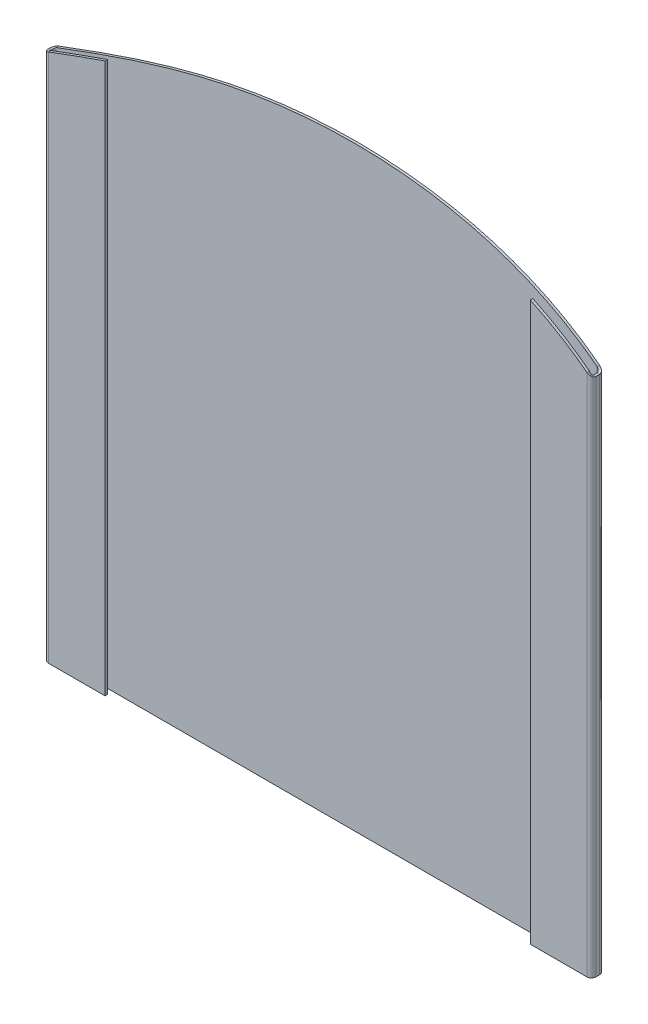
ISO-10303-21;
HEADER;
FILE_DESCRIPTION(('STEP AP214'),'2;1');
FILE_NAME('part.step','',(''),(''),'','','');
FILE_SCHEMA(('AUTOMOTIVE_DESIGN { 1 0 10303 214 1 1 1 1 }'));
ENDSEC;
DATA;
#1=APPLICATION_CONTEXT('core data for automotive mechanical design processes');
#2=APPLICATION_PROTOCOL_DEFINITION('international standard','automotive_design',2000,#1);
#3=PRODUCT_CONTEXT('',#1,'mechanical');
#4=PRODUCT('Part','Part','',(#3));
#5=PRODUCT_RELATED_PRODUCT_CATEGORY('part','',(#4));
#6=PRODUCT_DEFINITION_FORMATION('','',#4);
#7=PRODUCT_DEFINITION_CONTEXT('part definition',#1,'design');
#8=PRODUCT_DEFINITION('design','',#6,#7);
#9=PRODUCT_DEFINITION_SHAPE('','',#8);
#10=(LENGTH_UNIT() NAMED_UNIT(*) SI_UNIT(.MILLI.,.METRE.));
#11=(NAMED_UNIT(*) PLANE_ANGLE_UNIT() SI_UNIT($,.RADIAN.));
#12=(NAMED_UNIT(*) SI_UNIT($,.STERADIAN.) SOLID_ANGLE_UNIT());
#13=UNCERTAINTY_MEASURE_WITH_UNIT(LENGTH_MEASURE(1.E-05),#10,'distance_accuracy_value','');
#14=(GEOMETRIC_REPRESENTATION_CONTEXT(3) GLOBAL_UNCERTAINTY_ASSIGNED_CONTEXT((#13)) GLOBAL_UNIT_ASSIGNED_CONTEXT((#10,
#11,#12)) REPRESENTATION_CONTEXT('',''));
#15=CARTESIAN_POINT('',(0.,0.,0.));
#16=DIRECTION('',(0.,0.,1.));
#17=DIRECTION('',(1.,0.,0.));
#18=AXIS2_PLACEMENT_3D('',#15,#16,#17);
#19=CARTESIAN_POINT('',(-161.559079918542,-1.30491568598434E-13,1.524));
#20=DIRECTION('',(0.,0.,-1.));
#21=DIRECTION('',(-1.,0.,0.));
#22=AXIS2_PLACEMENT_3D('',#19,#20,#21);
#23=PLANE('',#22);
#24=CARTESIAN_POINT('',(-186.075855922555,319.635216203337,1.52400000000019));
#25=CARTESIAN_POINT('',(-133.874326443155,339.767219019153,1.52400000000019));
#26=CARTESIAN_POINT('',(-22.7801284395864,382.611724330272,1.52400000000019));
#27=CARTESIAN_POINT('',(158.42491735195,365.604160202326,1.52400000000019));
#28=CARTESIAN_POINT('',(227.026497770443,279.882523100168,1.52400000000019));
#29=CARTESIAN_POINT('',(254.929138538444,245.016561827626,1.52400000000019));
#30=B_SPLINE_CURVE_WITH_KNOTS('',3,(#24,#25,#26,#27,#28,#29),.UNSPECIFIED.,.F.,.F.,(4,1,1,4),
(0.,0.344632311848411,0.733439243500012,1.),.UNSPECIFIED.);
#31=CARTESIAN_POINT('',(-158.765079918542,330.093448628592,1.524));
#32=VERTEX_POINT('',#31);
#33=CARTESIAN_POINT('',(178.546920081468,326.451406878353,1.524));
#34=VERTEX_POINT('',#33);
#35=EDGE_CURVE('E166',#32,#34,#30,.T.);
#36=ORIENTED_EDGE('',*,*,#35,.F.);
#37=DIRECTION('',(0.,1.,0.));
#38=VECTOR('',#37,1.);
#39=CARTESIAN_POINT('',(-158.765079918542,-2032.,1.524));
#40=LINE('',#39,#38);
#41=CARTESIAN_POINT('',(-158.765079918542,-1.30491568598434E-13,1.524));
#42=VERTEX_POINT('',#41);
#43=EDGE_CURVE('E525',#42,#32,#40,.T.);
#44=ORIENTED_EDGE('',*,*,#43,.F.);
#45=DIRECTION('',(1.,0.,0.));
#46=VECTOR('',#45,1.);
#47=CARTESIAN_POINT('',(-161.559079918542,-1.30491568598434E-13,1.524));
#48=LINE('',#47,#46);
#49=CARTESIAN_POINT('',(178.546920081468,-1.30491568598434E-13,1.524));
#50=VERTEX_POINT('',#49);
#51=EDGE_CURVE('E11',#42,#50,#48,.T.);
#52=ORIENTED_EDGE('',*,*,#51,.T.);
#53=DIRECTION('',(0.,1.,0.));
#54=VECTOR('',#53,1.);
#55=CARTESIAN_POINT('',(178.546920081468,-2032.,1.524));
#56=LINE('',#55,#54);
#57=EDGE_CURVE('E190',#50,#34,#56,.T.);
#58=ORIENTED_EDGE('',*,*,#57,.T.);
#59=EDGE_LOOP('',(#36,#44,#52,#58));
#60=FACE_BOUND('',#59,.T.);
#61=ADVANCED_FACE('F30',(#60),#23,.F.);
#62=CARTESIAN_POINT('',(-161.559079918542,-1.30491568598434E-13,0.));
#63=DIRECTION('',(0.,0.,-1.));
#64=DIRECTION('',(-1.,0.,0.));
#65=AXIS2_PLACEMENT_3D('',#62,#63,#64);
#66=PLANE('',#65);
#67=DIRECTION('',(0.,1.,0.));
#68=VECTOR('',#67,1.);
#69=CARTESIAN_POINT('',(-158.765079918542,-2032.,0.));
#70=LINE('',#69,#68);
#71=CARTESIAN_POINT('',(-158.765079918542,-1.30491568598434E-13,0.));
#72=VERTEX_POINT('',#71);
#73=CARTESIAN_POINT('',(-158.765079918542,330.093448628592,0.));
#74=VERTEX_POINT('',#73);
#75=EDGE_CURVE('E183',#72,#74,#70,.T.);
#76=ORIENTED_EDGE('',*,*,#75,.T.);
#77=CARTESIAN_POINT('',(-186.075855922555,319.635216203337,1.91903784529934E-13));
#78=CARTESIAN_POINT('',(-133.874326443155,339.767219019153,1.91903784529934E-13));
#79=CARTESIAN_POINT('',(-22.7801284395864,382.611724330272,1.91903784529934E-13));
#80=CARTESIAN_POINT('',(158.42491735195,365.604160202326,1.91903784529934E-13));
#81=CARTESIAN_POINT('',(227.026497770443,279.882523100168,1.91903784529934E-13));
#82=CARTESIAN_POINT('',(254.929138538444,245.016561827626,1.91903784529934E-13));
#83=B_SPLINE_CURVE_WITH_KNOTS('',3,(#77,#78,#79,#80,#81,#82),.UNSPECIFIED.,.F.,.F.,(4,1,1,4),
(0.,0.344632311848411,0.733439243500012,1.),.UNSPECIFIED.);
#84=CARTESIAN_POINT('',(178.546920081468,326.451406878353,0.));
#85=VERTEX_POINT('',#84);
#86=EDGE_CURVE('E172',#74,#85,#83,.T.);
#87=ORIENTED_EDGE('',*,*,#86,.T.);
#88=DIRECTION('',(0.,1.,0.));
#89=VECTOR('',#88,1.);
#90=CARTESIAN_POINT('',(178.546920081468,-2032.,0.));
#91=LINE('',#90,#89);
#92=CARTESIAN_POINT('',(178.546920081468,0.,0.));
#93=VERTEX_POINT('',#92);
#94=EDGE_CURVE('E202',#93,#85,#91,.T.);
#95=ORIENTED_EDGE('',*,*,#94,.F.);
#96=DIRECTION('',(1.,0.,0.));
#97=VECTOR('',#96,1.);
#98=CARTESIAN_POINT('',(-161.559079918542,-1.30491568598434E-13,0.));
#99=LINE('',#98,#97);
#100=EDGE_CURVE('E38',#72,#93,#99,.T.);
#101=ORIENTED_EDGE('',*,*,#100,.F.);
#102=EDGE_LOOP('',(#76,#87,#95,#101));
#103=FACE_BOUND('',#102,.T.);
#104=ADVANCED_FACE('F263',(#103),#66,.T.);
#105=CARTESIAN_POINT('',(143.240920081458,-1.30491568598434E-13,7.874));
#106=DIRECTION('',(-1.,0.,0.));
#107=DIRECTION('',(0.,1.,0.));
#108=AXIS2_PLACEMENT_3D('',#105,#106,#107);
#109=PLANE('',#108);
#110=DIRECTION('',(0.,1.,0.));
#111=VECTOR('',#110,1.);
#112=CARTESIAN_POINT('',(143.240920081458,-1.30491568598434E-13,7.874));
#113=LINE('',#112,#111);
#114=CARTESIAN_POINT('',(143.240920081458,-1.30491568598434E-13,7.874));
#115=VERTEX_POINT('',#114);
#116=CARTESIAN_POINT('',(143.240920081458,347.969491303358,7.874));
#117=VERTEX_POINT('',#116);
#118=EDGE_CURVE('E218',#115,#117,#113,.T.);
#119=ORIENTED_EDGE('',*,*,#118,.T.);
#120=DIRECTION('',(0.,0.,1.));
#121=VECTOR('',#120,1.);
#122=CARTESIAN_POINT('',(143.240920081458,347.969491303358,7.874));
#123=LINE('',#122,#121);
#124=CARTESIAN_POINT('',(143.240920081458,347.969491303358,6.35));
#125=VERTEX_POINT('',#124);
#126=EDGE_CURVE('E355',#117,#125,#123,.F.);
#127=ORIENTED_EDGE('',*,*,#126,.T.);
#128=DIRECTION('',(0.,1.,0.));
#129=VECTOR('',#128,1.);
#130=CARTESIAN_POINT('',(143.240920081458,-1.30491568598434E-13,6.35));
#131=LINE('',#130,#129);
#132=CARTESIAN_POINT('',(143.240920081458,-1.30491568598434E-13,6.35));
#133=VERTEX_POINT('',#132);
#134=EDGE_CURVE('E232',#133,#125,#131,.T.);
#135=ORIENTED_EDGE('',*,*,#134,.F.);
#136=DIRECTION('',(0.,0.,-1.));
#137=VECTOR('',#136,1.);
#138=CARTESIAN_POINT('',(143.240920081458,-1.30491568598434E-13,7.874));
#139=LINE('',#138,#137);
#140=EDGE_CURVE('E246',#115,#133,#139,.T.);
#141=ORIENTED_EDGE('',*,*,#140,.F.);
#142=EDGE_LOOP('',(#119,#127,#135,#141));
#143=FACE_BOUND('',#142,.T.);
#144=ADVANCED_FACE('F414',(#143),#109,.T.);
#145=CARTESIAN_POINT('',(179.816920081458,-1.30491568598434E-13,5.07999999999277));
#146=DIRECTION('',(1.,0.,4.74248811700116E-12));
#147=DIRECTION('',(4.74248811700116E-12,0.,-1.));
#148=AXIS2_PLACEMENT_3D('',#145,#146,#147);
#149=PLANE('',#148);
#150=DIRECTION('',(4.74248811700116E-12,0.,-1.));
#151=VECTOR('',#150,1.);
#152=CARTESIAN_POINT('',(179.816920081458,324.279763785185,5.07999999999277));
#153=LINE('',#152,#151);
#154=CARTESIAN_POINT('',(179.816920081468,324.279763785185,2.79400000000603));
#155=VERTEX_POINT('',#154);
#156=CARTESIAN_POINT('',(179.816920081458,324.279763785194,5.07999999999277));
#157=VERTEX_POINT('',#156);
#158=EDGE_CURVE('E286',#155,#157,#153,.F.);
#159=ORIENTED_EDGE('',*,*,#158,.F.);
#160=DIRECTION('',(0.,1.,0.));
#161=VECTOR('',#160,1.);
#162=CARTESIAN_POINT('',(179.816920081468,-1.30491568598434E-13,2.79400000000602));
#163=LINE('',#162,#161);
#164=CARTESIAN_POINT('',(179.816920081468,0.,2.79400000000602));
#165=VERTEX_POINT('',#164);
#166=EDGE_CURVE('E193',#165,#155,#163,.T.);
#167=ORIENTED_EDGE('',*,*,#166,.F.);
#168=DIRECTION('',(4.74248811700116E-12,0.,-1.));
#169=VECTOR('',#168,1.);
#170=CARTESIAN_POINT('',(179.816920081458,-1.30491568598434E-13,5.07999999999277));
#171=LINE('',#170,#169);
#172=CARTESIAN_POINT('',(179.816920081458,-1.30491568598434E-13,5.07999999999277));
#173=VERTEX_POINT('',#172);
#174=EDGE_CURVE('E242',#173,#165,#171,.T.);
#175=ORIENTED_EDGE('',*,*,#174,.F.);
#176=DIRECTION('',(0.,1.,0.));
#177=VECTOR('',#176,1.);
#178=CARTESIAN_POINT('',(179.816920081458,-1.30491568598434E-13,5.07999999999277));
#179=LINE('',#178,#177);
#180=EDGE_CURVE('E228',#173,#157,#179,.T.);
#181=ORIENTED_EDGE('',*,*,#180,.T.);
#182=EDGE_LOOP('',(#159,#167,#175,#181));
#183=FACE_BOUND('',#182,.T.);
#184=ADVANCED_FACE('F284',(#183),#149,.F.);
#185=CARTESIAN_POINT('',(178.546920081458,-1.30491568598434E-13,5.08));
#186=DIRECTION('',(0.,1.,0.));
#187=DIRECTION('',(0.,0.,1.));
#188=AXIS2_PLACEMENT_3D('',#185,#186,#187);
#189=CYLINDRICAL_SURFACE('',#188,1.27);
#190=DIRECTION('',(0.,1.,0.));
#191=VECTOR('',#190,1.);
#192=CARTESIAN_POINT('',(178.546920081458,-1.30491568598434E-13,6.35));
#193=LINE('',#192,#191);
#194=CARTESIAN_POINT('',(178.546920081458,-1.30491568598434E-13,6.35));
#195=VERTEX_POINT('',#194);
#196=CARTESIAN_POINT('',(178.546920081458,326.451406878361,6.35000000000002));
#197=VERTEX_POINT('',#196);
#198=EDGE_CURVE('E227',#195,#197,#193,.T.);
#199=ORIENTED_EDGE('',*,*,#198,.T.);
#200=CARTESIAN_POINT('',(178.546920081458,326.451406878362,6.35000000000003));
#201=CARTESIAN_POINT('',(178.59101913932,326.37726110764,6.34997991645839));
#202=CARTESIAN_POINT('',(178.63505240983,326.3030694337,6.3477018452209));
#203=CARTESIAN_POINT('',(178.723096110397,326.154461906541,6.33850900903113));
#204=CARTESIAN_POINT('',(178.767105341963,326.080046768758,6.33157128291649));
#205=CARTESIAN_POINT('',(178.85485974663,325.931448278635,6.31291740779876));
#206=CARTESIAN_POINT('',(178.898604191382,325.857265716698,6.30119146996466));
#207=CARTESIAN_POINT('',(178.987028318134,325.707040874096,6.2722433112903));
#208=CARTESIAN_POINT('',(179.031689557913,325.63102060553,6.25484853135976));
#209=CARTESIAN_POINT('',(179.120152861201,325.48017268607,6.21431392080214));
#210=CARTESIAN_POINT('',(179.163956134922,325.405343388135,6.19118292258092));
#211=CARTESIAN_POINT('',(179.250413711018,325.257395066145,6.13856391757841));
#212=CARTESIAN_POINT('',(179.293069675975,325.184273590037,6.10908573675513));
#213=CARTESIAN_POINT('',(179.359893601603,325.069555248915,6.05620855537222));
#214=CARTESIAN_POINT('',(179.384566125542,325.027161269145,6.03516760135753));
#215=CARTESIAN_POINT('',(179.433218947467,324.943490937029,5.99020473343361));
#216=CARTESIAN_POINT('',(179.457199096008,324.902214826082,5.96628220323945));
#217=CARTESIAN_POINT('',(179.504100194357,324.821389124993,5.91540198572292));
#218=CARTESIAN_POINT('',(179.527026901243,324.781830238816,5.88846452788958));
#219=CARTESIAN_POINT('',(179.571698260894,324.704697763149,5.83103415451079));
#220=CARTESIAN_POINT('',(179.59344370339,324.667122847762,5.80054365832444));
#221=CARTESIAN_POINT('',(179.636874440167,324.592029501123,5.73316296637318));
#222=CARTESIAN_POINT('',(179.658441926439,324.554711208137,5.69596958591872));
#223=CARTESIAN_POINT('',(179.699001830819,324.484439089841,5.61628853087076));
#224=CARTESIAN_POINT('',(179.717994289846,324.451485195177,5.57380094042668));
#225=CARTESIAN_POINT('',(179.748744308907,324.398134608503,5.49231823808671));
#226=CARTESIAN_POINT('',(179.761187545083,324.376547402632,5.45437482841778));
#227=CARTESIAN_POINT('',(179.782848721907,324.338962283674,5.375057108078));
#228=CARTESIAN_POINT('',(179.792078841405,324.322943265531,5.33369650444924));
#229=CARTESIAN_POINT('',(179.804968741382,324.30057204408,5.25715894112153));
#230=CARTESIAN_POINT('',(179.809390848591,324.292896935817,5.22250480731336));
#231=CARTESIAN_POINT('',(179.813876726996,324.285087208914,5.16965770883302));
#232=CARTESIAN_POINT('',(179.815014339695,324.283100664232,5.15181433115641));
#233=CARTESIAN_POINT('',(179.816537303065,324.280436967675,5.115983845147));
#234=CARTESIAN_POINT('',(179.816922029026,324.279760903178,5.09799662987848));
#235=CARTESIAN_POINT('',(179.816920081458,324.279763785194,5.07999999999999));
#236=B_SPLINE_CURVE_WITH_KNOTS('',3,(#200,#201,#202,#203,#204,#205,#206,#207,#208,#209,#210,
#211,#212,#213,#214,#215,#216,#217,#218,#219,#220,#221,#222,#223,#224,#225,#226,#227,#228,#229,
#230,#231,#232,#233,#234,#235),.UNSPECIFIED.,.F.,.F.,(4,2,2,2,2,2,2,2,2,2,2,2,2,2,2,2,2,4),(0.,
0.258786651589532,0.518857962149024,0.779463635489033,1.04888780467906,1.31789967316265,
1.58649804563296,1.74654143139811,1.90661910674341,2.06568069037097,2.22463459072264,
2.39507041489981,2.56550353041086,2.70121753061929,2.83641137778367,2.94324610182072,
2.99715733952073,3.05111329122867),.UNSPECIFIED.);
#237=EDGE_CURVE('E363',#197,#157,#236,.T.);
#238=ORIENTED_EDGE('',*,*,#237,.T.);
#239=ORIENTED_EDGE('',*,*,#180,.F.);
#240=CARTESIAN_POINT('',(178.546920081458,-1.30491568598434E-13,5.08));
#241=DIRECTION('',(0.,1.,0.));
#242=DIRECTION('',(0.,0.,1.));
#243=AXIS2_PLACEMENT_3D('',#240,#241,#242);
#244=CIRCLE('',#243,1.27);
#245=EDGE_CURVE('E231',#173,#195,#244,.F.);
#246=ORIENTED_EDGE('',*,*,#245,.T.);
#247=EDGE_LOOP('',(#199,#238,#239,#246));
#248=FACE_BOUND('',#247,.T.);
#249=ADVANCED_FACE('F432',(#248),#189,.F.);
#250=CARTESIAN_POINT('',(181.340920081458,-1.30491568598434E-13,6.35));
#251=DIRECTION('',(0.,0.,-1.));
#252=DIRECTION('',(-1.,0.,0.));
#253=AXIS2_PLACEMENT_3D('',#250,#251,#252);
#254=PLANE('',#253);
#255=ORIENTED_EDGE('',*,*,#134,.T.);
#256=CARTESIAN_POINT('',(-186.075855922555,319.635216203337,6.35000000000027));
#257=CARTESIAN_POINT('',(-133.874326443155,339.767219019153,6.35000000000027));
#258=CARTESIAN_POINT('',(-22.7801284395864,382.611724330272,6.35000000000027));
#259=CARTESIAN_POINT('',(158.42491735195,365.604160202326,6.35000000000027));
#260=CARTESIAN_POINT('',(227.026497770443,279.882523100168,6.35000000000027));
#261=CARTESIAN_POINT('',(254.929138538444,245.016561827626,6.35000000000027));
#262=B_SPLINE_CURVE_WITH_KNOTS('',3,(#256,#257,#258,#259,#260,#261),.UNSPECIFIED.,.F.,.F.,(4,1,
1,4),(0.,0.344632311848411,0.733439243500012,1.),.UNSPECIFIED.);
#263=EDGE_CURVE('E347',#125,#197,#262,.T.);
#264=ORIENTED_EDGE('',*,*,#263,.T.);
#265=ORIENTED_EDGE('',*,*,#198,.F.);
#266=DIRECTION('',(-1.,0.,0.));
#267=VECTOR('',#266,1.);
#268=CARTESIAN_POINT('',(181.340920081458,-1.30491568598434E-13,6.35));
#269=LINE('',#268,#267);
#270=EDGE_CURVE('E235',#195,#133,#269,.T.);
#271=ORIENTED_EDGE('',*,*,#270,.T.);
#272=EDGE_LOOP('',(#255,#264,#265,#271));
#273=FACE_BOUND('',#272,.T.);
#274=ADVANCED_FACE('F429',(#273),#254,.T.);
#275=CARTESIAN_POINT('',(181.340920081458,-1.30491568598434E-13,5.08));
#276=DIRECTION('',(1.,0.,4.74248811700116E-12));
#277=DIRECTION('',(4.74248811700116E-12,0.,-1.));
#278=AXIS2_PLACEMENT_3D('',#275,#276,#277);
#279=PLANE('',#278);
#280=DIRECTION('',(0.,1.,0.));
#281=VECTOR('',#280,1.);
#282=CARTESIAN_POINT('',(181.340920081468,0.,2.79400000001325));
#283=LINE('',#282,#281);
#284=CARTESIAN_POINT('',(181.340920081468,0.,2.79400000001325));
#285=VERTEX_POINT('',#284);
#286=CARTESIAN_POINT('',(181.340920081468,324.279763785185,2.79400000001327));
#287=VERTEX_POINT('',#286);
#288=EDGE_CURVE('E210',#285,#287,#283,.T.);
#289=ORIENTED_EDGE('',*,*,#288,.T.);
#290=DIRECTION('',(0.,0.,-1.));
#291=VECTOR('',#290,1.);
#292=CARTESIAN_POINT('',(181.34092007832,324.279763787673,666.645750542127));
#293=LINE('',#292,#291);
#294=CARTESIAN_POINT('',(181.340920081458,324.279763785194,5.08));
#295=VERTEX_POINT('',#294);
#296=EDGE_CURVE('E276',#287,#295,#293,.F.);
#297=ORIENTED_EDGE('',*,*,#296,.T.);
#298=DIRECTION('',(0.,1.,0.));
#299=VECTOR('',#298,1.);
#300=CARTESIAN_POINT('',(181.340920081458,-1.30491568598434E-13,5.08));
#301=LINE('',#300,#299);
#302=CARTESIAN_POINT('',(181.340920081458,-1.30491568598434E-13,5.08));
#303=VERTEX_POINT('',#302);
#304=EDGE_CURVE('E214',#303,#295,#301,.T.);
#305=ORIENTED_EDGE('',*,*,#304,.F.);
#306=DIRECTION('',(4.74248811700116E-12,0.,-1.));
#307=VECTOR('',#306,1.);
#308=CARTESIAN_POINT('',(181.340920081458,-1.30491568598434E-13,5.08));
#309=LINE('',#308,#307);
#310=EDGE_CURVE('E207',#303,#285,#309,.T.);
#311=ORIENTED_EDGE('',*,*,#310,.T.);
#312=EDGE_LOOP('',(#289,#297,#305,#311));
#313=FACE_BOUND('',#312,.T.);
#314=ADVANCED_FACE('F274',(#313),#279,.T.);
#315=CARTESIAN_POINT('',(178.546920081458,-1.30491568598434E-13,5.08));
#316=DIRECTION('',(0.,1.,0.));
#317=DIRECTION('',(0.,0.,1.));
#318=AXIS2_PLACEMENT_3D('',#315,#316,#317);
#319=CYLINDRICAL_SURFACE('',#318,2.794);
#320=CARTESIAN_POINT('',(178.546920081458,326.451406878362,7.87400000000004));
#321=CARTESIAN_POINT('',(178.644976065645,326.376468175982,7.87398731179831));
#322=CARTESIAN_POINT('',(178.742958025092,326.301425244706,7.86883697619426));
#323=CARTESIAN_POINT('',(178.938176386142,326.151644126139,7.84821525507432));
#324=CARTESIAN_POINT('',(179.035412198,326.076906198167,7.8327364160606));
#325=CARTESIAN_POINT('',(179.228985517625,325.927905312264,7.79128584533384));
#326=CARTESIAN_POINT('',(179.325313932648,325.853648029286,7.76525070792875));
#327=CARTESIAN_POINT('',(179.515611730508,325.706687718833,7.70261480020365));
#328=CARTESIAN_POINT('',(179.609581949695,325.633984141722,7.6660178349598));
#329=CARTESIAN_POINT('',(179.852190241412,325.44595393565,7.55586587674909));
#330=CARTESIAN_POINT('',(179.998313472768,325.332368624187,7.47350432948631));
#331=CARTESIAN_POINT('',(180.27760668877,325.114792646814,7.27998140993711));
#332=CARTESIAN_POINT('',(180.410809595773,325.010777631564,7.16889602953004));
#333=CARTESIAN_POINT('',(180.633271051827,324.836656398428,6.94365547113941));
#334=CARTESIAN_POINT('',(180.725927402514,324.763980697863,6.83485621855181));
#335=CARTESIAN_POINT('',(180.896082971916,324.630367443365,6.59950152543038));
#336=CARTESIAN_POINT('',(180.973594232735,324.569420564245,6.4729603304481));
#337=CARTESIAN_POINT('',(181.09849175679,324.471054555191,6.22542020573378));
#338=CARTESIAN_POINT('',(181.148706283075,324.431436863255,6.1067262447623));
#339=CARTESIAN_POINT('',(181.232862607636,324.365055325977,5.86039000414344));
#340=CARTESIAN_POINT('',(181.266833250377,324.33826869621,5.73276405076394));
#341=CARTESIAN_POINT('',(181.307905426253,324.305873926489,5.51699634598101));
#342=CARTESIAN_POINT('',(181.320233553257,324.2961474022,5.43042473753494));
#343=CARTESIAN_POINT('',(181.336762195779,324.283090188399,5.25592499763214));
#344=CARTESIAN_POINT('',(181.340952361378,324.279767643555,5.16799528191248));
#345=CARTESIAN_POINT('',(181.340920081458,324.279763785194,5.07999999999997));
#346=B_SPLINE_CURVE_WITH_KNOTS('',3,(#320,#321,#322,#323,#324,#325,#326,#327,#328,#329,#330,
#331,#332,#333,#334,#335,#336,#337,#338,#339,#340,#341,#342,#343,#344,#345),.UNSPECIFIED.,.F.,
.F.,(4,2,2,2,2,2,2,2,2,2,2,2,4),(0.,0.370138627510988,0.740544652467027,1.11320925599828,
1.48573976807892,2.09095423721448,2.69458364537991,3.17374768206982,3.65252916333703,
4.05536261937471,4.45747807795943,4.72085117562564,4.9845590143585),.UNSPECIFIED.);
#347=CARTESIAN_POINT('',(178.546920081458,326.451406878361,7.87400000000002));
#348=VERTEX_POINT('',#347);
#349=EDGE_CURVE('E194',#348,#295,#346,.T.);
#350=ORIENTED_EDGE('',*,*,#349,.F.);
#351=DIRECTION('',(0.,1.,0.));
#352=VECTOR('',#351,1.);
#353=CARTESIAN_POINT('',(178.546920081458,-1.30491568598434E-13,7.874));
#354=LINE('',#353,#352);
#355=CARTESIAN_POINT('',(178.546920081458,-1.30491568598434E-13,7.874));
#356=VERTEX_POINT('',#355);
#357=EDGE_CURVE('E206',#356,#348,#354,.T.);
#358=ORIENTED_EDGE('',*,*,#357,.F.);
#359=CARTESIAN_POINT('',(178.546920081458,-1.30491568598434E-13,5.08));
#360=DIRECTION('',(0.,1.,0.));
#361=DIRECTION('',(0.,0.,1.));
#362=AXIS2_PLACEMENT_3D('',#359,#360,#361);
#363=CIRCLE('',#362,2.794);
#364=EDGE_CURVE('E211',#303,#356,#363,.F.);
#365=ORIENTED_EDGE('',*,*,#364,.F.);
#366=ORIENTED_EDGE('',*,*,#304,.T.);
#367=EDGE_LOOP('',(#350,#358,#365,#366));
#368=FACE_BOUND('',#367,.T.);
#369=ADVANCED_FACE('F440',(#368),#319,.T.);
#370=CARTESIAN_POINT('',(181.340920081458,-1.30491568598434E-13,7.874));
#371=DIRECTION('',(0.,0.,-1.));
#372=DIRECTION('',(-1.,0.,0.));
#373=AXIS2_PLACEMENT_3D('',#370,#371,#372);
#374=PLANE('',#373);
#375=CARTESIAN_POINT('',(-186.075855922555,319.635216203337,7.87400000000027));
#376=CARTESIAN_POINT('',(-133.874326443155,339.767219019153,7.87400000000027));
#377=CARTESIAN_POINT('',(-22.7801284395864,382.611724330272,7.87400000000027));
#378=CARTESIAN_POINT('',(158.42491735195,365.604160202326,7.87400000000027));
#379=CARTESIAN_POINT('',(227.026497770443,279.882523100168,7.87400000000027));
#380=CARTESIAN_POINT('',(254.929138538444,245.016561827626,7.87400000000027));
#381=B_SPLINE_CURVE_WITH_KNOTS('',3,(#375,#376,#377,#378,#379,#380),.UNSPECIFIED.,.F.,.F.,(4,1,
1,4),(0.,0.344632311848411,0.733439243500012,1.),.UNSPECIFIED.);
#382=EDGE_CURVE('E360',#117,#348,#381,.T.);
#383=ORIENTED_EDGE('',*,*,#382,.F.);
#384=ORIENTED_EDGE('',*,*,#118,.F.);
#385=DIRECTION('',(-1.,0.,0.));
#386=VECTOR('',#385,1.);
#387=CARTESIAN_POINT('',(181.340920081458,-1.30491568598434E-13,7.874));
#388=LINE('',#387,#386);
#389=EDGE_CURVE('E215',#356,#115,#388,.T.);
#390=ORIENTED_EDGE('',*,*,#389,.F.);
#391=ORIENTED_EDGE('',*,*,#357,.T.);
#392=EDGE_LOOP('',(#383,#384,#390,#391));
#393=FACE_BOUND('',#392,.T.);
#394=ADVANCED_FACE('F443',(#393),#374,.F.);
#395=CARTESIAN_POINT('',(178.546920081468,-2032.,2.794));
#396=DIRECTION('',(0.,1.,0.));
#397=DIRECTION('',(0.,0.,1.));
#398=AXIS2_PLACEMENT_3D('',#395,#396,#397);
#399=CYLINDRICAL_SURFACE('',#398,1.27);
#400=CARTESIAN_POINT('',(178.546920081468,326.451406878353,1.524));
#401=CARTESIAN_POINT('',(178.591019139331,326.377261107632,1.52402008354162));
#402=CARTESIAN_POINT('',(178.635052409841,326.303069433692,1.5262981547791));
#403=CARTESIAN_POINT('',(178.723096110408,326.154461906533,1.53549099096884));
#404=CARTESIAN_POINT('',(178.767105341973,326.08004676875,1.54242871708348));
#405=CARTESIAN_POINT('',(178.85485974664,325.931448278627,1.56108259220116));
#406=CARTESIAN_POINT('',(178.898604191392,325.85726571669,1.57280853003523));
#407=CARTESIAN_POINT('',(178.987028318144,325.707040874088,1.60175668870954));
#408=CARTESIAN_POINT('',(179.031689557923,325.631020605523,1.61915146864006));
#409=CARTESIAN_POINT('',(179.120152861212,325.480172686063,1.65968607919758));
#410=CARTESIAN_POINT('',(179.163956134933,325.405343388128,1.6828170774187));
#411=CARTESIAN_POINT('',(179.250413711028,325.257395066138,1.73543608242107));
#412=CARTESIAN_POINT('',(179.293069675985,325.18427359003,1.76491426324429));
#413=CARTESIAN_POINT('',(179.359893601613,325.069555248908,1.8177914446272));
#414=CARTESIAN_POINT('',(179.384566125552,325.027161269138,1.83883239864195));
#415=CARTESIAN_POINT('',(179.433218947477,324.943490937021,1.88379526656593));
#416=CARTESIAN_POINT('',(179.457199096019,324.902214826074,1.90771779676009));
#417=CARTESIAN_POINT('',(179.504100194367,324.821389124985,1.9585980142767));
#418=CARTESIAN_POINT('',(179.527026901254,324.781830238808,1.98553547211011));
#419=CARTESIAN_POINT('',(179.571698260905,324.704697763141,2.04296584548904));
#420=CARTESIAN_POINT('',(179.593443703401,324.667122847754,2.07345634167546));
#421=CARTESIAN_POINT('',(179.636874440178,324.592029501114,2.14083703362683));
#422=CARTESIAN_POINT('',(179.65844192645,324.554711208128,2.17803041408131));
#423=CARTESIAN_POINT('',(179.699001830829,324.484439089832,2.25771146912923));
#424=CARTESIAN_POINT('',(179.717994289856,324.451485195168,2.30019905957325));
#425=CARTESIAN_POINT('',(179.748744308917,324.398134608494,2.38168176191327));
#426=CARTESIAN_POINT('',(179.761187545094,324.376547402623,2.41962517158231));
#427=CARTESIAN_POINT('',(179.782848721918,324.338962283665,2.49894289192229));
#428=CARTESIAN_POINT('',(179.792078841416,324.322943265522,2.54030349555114));
#429=CARTESIAN_POINT('',(179.804968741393,324.300572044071,2.6168410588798));
#430=CARTESIAN_POINT('',(179.809390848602,324.292896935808,2.65149519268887));
#431=CARTESIAN_POINT('',(179.813876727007,324.285087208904,2.70434229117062));
#432=CARTESIAN_POINT('',(179.815014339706,324.283100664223,2.72218566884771));
#433=CARTESIAN_POINT('',(179.816537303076,324.280436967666,2.75801615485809));
#434=CARTESIAN_POINT('',(179.816922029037,324.279760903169,2.77600337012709));
#435=CARTESIAN_POINT('',(179.816920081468,324.279763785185,2.79400000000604));
#436=B_SPLINE_CURVE_WITH_KNOTS('',3,(#400,#401,#402,#403,#404,#405,#406,#407,#408,#409,#410,
#411,#412,#413,#414,#415,#416,#417,#418,#419,#420,#421,#422,#423,#424,#425,#426,#427,#428,#429,
#430,#431,#432,#433,#434,#435),.UNSPECIFIED.,.F.,.F.,(4,2,2,2,2,2,2,2,2,2,2,2,2,2,2,2,2,4),(0.,
0.25878665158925,0.518857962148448,0.779463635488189,1.04888780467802,1.31789967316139,
1.58649804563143,1.74654143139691,1.90661910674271,2.06568069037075,2.22463459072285,
2.39507041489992,2.56550353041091,2.7012175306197,2.83641137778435,2.94324610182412,
2.99715733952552,3.05111329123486),.UNSPECIFIED.);
#437=EDGE_CURVE('E179',#34,#155,#436,.T.);
#438=ORIENTED_EDGE('',*,*,#437,.F.);
#439=ORIENTED_EDGE('',*,*,#57,.F.);
#440=CARTESIAN_POINT('',(178.546920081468,0.,2.794));
#441=DIRECTION('',(0.,1.,0.));
#442=DIRECTION('',(0.,0.,1.));
#443=AXIS2_PLACEMENT_3D('',#440,#441,#442);
#444=CIRCLE('',#443,1.27);
#445=EDGE_CURVE('E196',#165,#50,#444,.T.);
#446=ORIENTED_EDGE('',*,*,#445,.F.);
#447=ORIENTED_EDGE('',*,*,#166,.T.);
#448=EDGE_LOOP('',(#438,#439,#446,#447));
#449=FACE_BOUND('',#448,.T.);
#450=ADVANCED_FACE('F188',(#449),#399,.F.);
#451=CARTESIAN_POINT('',(178.546920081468,-2032.,2.794));
#452=DIRECTION('',(0.,1.,0.));
#453=DIRECTION('',(0.,0.,1.));
#454=AXIS2_PLACEMENT_3D('',#451,#452,#453);
#455=CYLINDRICAL_SURFACE('',#454,2.794);
#456=ORIENTED_EDGE('',*,*,#94,.T.);
#457=CARTESIAN_POINT('',(178.546920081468,326.451406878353,0.));
#458=CARTESIAN_POINT('',(178.644976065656,326.376468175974,1.2688201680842E-05));
#459=CARTESIAN_POINT('',(178.742958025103,326.301425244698,0.00516302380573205));
#460=CARTESIAN_POINT('',(178.938176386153,326.151644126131,0.0257847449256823));
#461=CARTESIAN_POINT('',(179.035412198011,326.076906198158,0.0412635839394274));
#462=CARTESIAN_POINT('',(179.228985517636,325.927905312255,0.0827141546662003));
#463=CARTESIAN_POINT('',(179.325313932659,325.853648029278,0.108749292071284));
#464=CARTESIAN_POINT('',(179.515611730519,325.706687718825,0.171385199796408));
#465=CARTESIAN_POINT('',(179.609581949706,325.633984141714,0.20798216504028));
#466=CARTESIAN_POINT('',(179.852190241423,325.445953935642,0.318134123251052));
#467=CARTESIAN_POINT('',(179.998313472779,325.332368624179,0.400495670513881));
#468=CARTESIAN_POINT('',(180.277606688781,325.114792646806,0.594018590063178));
#469=CARTESIAN_POINT('',(180.410809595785,325.010777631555,0.7051039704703));
#470=CARTESIAN_POINT('',(180.633271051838,324.836656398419,0.930344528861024));
#471=CARTESIAN_POINT('',(180.725927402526,324.763980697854,1.03914378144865));
#472=CARTESIAN_POINT('',(180.896082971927,324.630367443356,1.27449847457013));
#473=CARTESIAN_POINT('',(180.973594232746,324.569420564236,1.40103966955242));
#474=CARTESIAN_POINT('',(181.098491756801,324.471054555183,1.64857979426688));
#475=CARTESIAN_POINT('',(181.148706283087,324.431436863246,1.76727375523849));
#476=CARTESIAN_POINT('',(181.232862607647,324.365055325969,2.01360999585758));
#477=CARTESIAN_POINT('',(181.266833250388,324.338268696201,2.14123594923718));
#478=CARTESIAN_POINT('',(181.307905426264,324.30587392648,2.35700365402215));
#479=CARTESIAN_POINT('',(181.320233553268,324.296147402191,2.44357526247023));
#480=CARTESIAN_POINT('',(181.336762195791,324.28309018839,2.61807500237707));
#481=CARTESIAN_POINT('',(181.34095236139,324.279767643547,2.70600471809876));
#482=CARTESIAN_POINT('',(181.340920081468,324.279763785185,2.79400000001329));
#483=B_SPLINE_CURVE_WITH_KNOTS('',3,(#457,#458,#459,#460,#461,#462,#463,#464,#465,#466,#467,
#468,#469,#470,#471,#472,#473,#474,#475,#476,#477,#478,#479,#480,#481,#482),.UNSPECIFIED.,.F.,
.F.,(4,2,2,2,2,2,2,2,2,2,2,2,4),(0.,0.370138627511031,0.74054465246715,1.11320925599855,
1.48573976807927,2.09095423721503,2.69458364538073,3.17374768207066,3.65252916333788,
4.05536261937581,4.4574780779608,4.72085117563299,4.98455901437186),.UNSPECIFIED.);
#484=EDGE_CURVE('E182',#85,#287,#483,.T.);
#485=ORIENTED_EDGE('',*,*,#484,.T.);
#486=ORIENTED_EDGE('',*,*,#288,.F.);
#487=CARTESIAN_POINT('',(178.546920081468,0.,2.794));
#488=DIRECTION('',(0.,-1.,0.));
#489=DIRECTION('',(1.,0.,0.));
#490=AXIS2_PLACEMENT_3D('',#487,#488,#489);
#491=CIRCLE('',#490,2.794);
#492=EDGE_CURVE('E197',#285,#93,#491,.F.);
#493=ORIENTED_EDGE('',*,*,#492,.T.);
#494=EDGE_LOOP('',(#456,#485,#486,#493));
#495=FACE_BOUND('',#494,.T.);
#496=ADVANCED_FACE('F271',(#495),#455,.T.);
#497=CARTESIAN_POINT('',(-123.459079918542,-1.30491568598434E-13,6.35));
#498=DIRECTION('',(1.,0.,0.));
#499=DIRECTION('',(0.,1.,0.));
#500=AXIS2_PLACEMENT_3D('',#497,#498,#499);
#501=PLANE('',#500);
#502=DIRECTION('',(0.,0.,-1.));
#503=VECTOR('',#502,1.);
#504=CARTESIAN_POINT('',(-123.459079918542,342.897505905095,4.826));
#505=LINE('',#504,#503);
#506=CARTESIAN_POINT('',(-123.459079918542,342.897505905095,4.826));
#507=VERTEX_POINT('',#506);
#508=CARTESIAN_POINT('',(-123.459079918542,342.897505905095,6.35));
#509=VERTEX_POINT('',#508);
#510=EDGE_CURVE('E611',#507,#509,#505,.F.);
#511=ORIENTED_EDGE('',*,*,#510,.T.);
#512=DIRECTION('',(0.,1.,0.));
#513=VECTOR('',#512,1.);
#514=CARTESIAN_POINT('',(-123.459079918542,-1.30491568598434E-13,6.35));
#515=LINE('',#514,#513);
#516=CARTESIAN_POINT('',(-123.459079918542,-1.30491568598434E-13,6.35));
#517=VERTEX_POINT('',#516);
#518=EDGE_CURVE('E543',#517,#509,#515,.T.);
#519=ORIENTED_EDGE('',*,*,#518,.F.);
#520=DIRECTION('',(0.,0.,1.));
#521=VECTOR('',#520,1.);
#522=CARTESIAN_POINT('',(-123.459079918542,-1.30491568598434E-13,6.35));
#523=LINE('',#522,#521);
#524=CARTESIAN_POINT('',(-123.459079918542,-1.30491568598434E-13,4.826));
#525=VERTEX_POINT('',#524);
#526=EDGE_CURVE('E573',#517,#525,#523,.F.);
#527=ORIENTED_EDGE('',*,*,#526,.T.);
#528=DIRECTION('',(0.,1.,0.));
#529=VECTOR('',#528,1.);
#530=CARTESIAN_POINT('',(-123.459079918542,-1.30491568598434E-13,4.826));
#531=LINE('',#530,#529);
#532=EDGE_CURVE('E557',#525,#507,#531,.T.);
#533=ORIENTED_EDGE('',*,*,#532,.T.);
#534=EDGE_LOOP('',(#511,#519,#527,#533));
#535=FACE_BOUND('',#534,.T.);
#536=ADVANCED_FACE('F455',(#535),#501,.T.);
#537=CARTESIAN_POINT('',(-160.035079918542,-1.30491568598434E-13,3.556));
#538=DIRECTION('',(1.,0.,0.));
#539=DIRECTION('',(0.,0.,-1.));
#540=AXIS2_PLACEMENT_3D('',#537,#538,#539);
#541=PLANE('',#540);
#542=DIRECTION('',(0.,1.,0.));
#543=VECTOR('',#542,1.);
#544=CARTESIAN_POINT('',(-160.035079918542,-1.30491568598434E-13,2.794));
#545=LINE('',#544,#543);
#546=CARTESIAN_POINT('',(-160.035079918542,-1.30491568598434E-13,2.794));
#547=VERTEX_POINT('',#546);
#548=CARTESIAN_POINT('',(-160.035079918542,329.036471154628,2.794));
#549=VERTEX_POINT('',#548);
#550=EDGE_CURVE('E570',#547,#549,#545,.T.);
#551=ORIENTED_EDGE('',*,*,#550,.T.);
#552=DIRECTION('',(0.,0.,-1.));
#553=VECTOR('',#552,1.);
#554=CARTESIAN_POINT('',(-160.035079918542,329.036471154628,3.556));
#555=LINE('',#554,#553);
#556=CARTESIAN_POINT('',(-160.035079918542,329.036471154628,3.556));
#557=VERTEX_POINT('',#556);
#558=EDGE_CURVE('E599',#549,#557,#555,.F.);
#559=ORIENTED_EDGE('',*,*,#558,.T.);
#560=DIRECTION('',(0.,1.,0.));
#561=VECTOR('',#560,1.);
#562=CARTESIAN_POINT('',(-160.035079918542,-1.30491568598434E-13,3.556));
#563=LINE('',#562,#561);
#564=CARTESIAN_POINT('',(-160.035079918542,-1.30491568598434E-13,3.556));
#565=VERTEX_POINT('',#564);
#566=EDGE_CURVE('E553',#565,#557,#563,.T.);
#567=ORIENTED_EDGE('',*,*,#566,.F.);
#568=DIRECTION('',(0.,0.,-1.));
#569=VECTOR('',#568,1.);
#570=CARTESIAN_POINT('',(-160.035079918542,-1.30491568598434E-13,3.556));
#571=LINE('',#570,#569);
#572=EDGE_CURVE('E567',#565,#547,#571,.T.);
#573=ORIENTED_EDGE('',*,*,#572,.T.);
#574=EDGE_LOOP('',(#551,#559,#567,#573));
#575=FACE_BOUND('',#574,.T.);
#576=ADVANCED_FACE('F470',(#575),#541,.T.);
#577=CARTESIAN_POINT('',(-158.765079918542,-1.30491568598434E-13,3.556));
#578=DIRECTION('',(0.,1.,0.));
#579=DIRECTION('',(0.,0.,1.));
#580=AXIS2_PLACEMENT_3D('',#577,#578,#579);
#581=CYLINDRICAL_SURFACE('',#580,1.27);
#582=CARTESIAN_POINT('',(-158.765079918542,330.093448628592,4.82599999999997));
#583=CARTESIAN_POINT('',(-158.806292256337,330.059223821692,4.82599220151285));
#584=CARTESIAN_POINT('',(-158.847480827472,330.025007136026,4.82399336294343));
#585=CARTESIAN_POINT('',(-158.929640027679,329.956739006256,4.8159722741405));
#586=CARTESIAN_POINT('',(-158.970610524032,329.922687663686,4.80994780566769));
#587=CARTESIAN_POINT('',(-159.093337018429,329.820674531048,4.78568496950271));
#588=CARTESIAN_POINT('',(-159.174431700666,329.753249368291,4.76125607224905));
#589=CARTESIAN_POINT('',(-159.323511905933,329.629238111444,4.699165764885));
#590=CARTESIAN_POINT('',(-159.391945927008,329.572285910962,4.66330192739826));
#591=CARTESIAN_POINT('',(-159.523406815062,329.462854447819,4.57774497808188));
#592=CARTESIAN_POINT('',(-159.586447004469,329.410364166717,4.52808730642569));
#593=CARTESIAN_POINT('',(-159.691180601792,329.323117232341,4.42735884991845));
#594=CARTESIAN_POINT('',(-159.734485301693,329.287028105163,4.37912103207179));
#595=CARTESIAN_POINT('',(-159.814597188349,329.220290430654,4.27416133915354));
#596=CARTESIAN_POINT('',(-159.851410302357,329.189636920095,4.21744729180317));
#597=CARTESIAN_POINT('',(-159.910830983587,329.140099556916,4.10680439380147));
#598=CARTESIAN_POINT('',(-159.934795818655,329.12009580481,4.05410868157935));
#599=CARTESIAN_POINT('',(-159.975674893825,329.085991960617,3.94429991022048));
#600=CARTESIAN_POINT('',(-159.992602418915,329.071880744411,3.88719541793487));
#601=CARTESIAN_POINT('',(-160.01519227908,329.053065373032,3.78439725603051));
#602=CARTESIAN_POINT('',(-160.022600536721,329.046901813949,3.7393470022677));
#603=CARTESIAN_POINT('',(-160.032567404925,329.038599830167,3.64821463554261));
#604=CARTESIAN_POINT('',(-160.035111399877,329.036473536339,3.60212983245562));
#605=CARTESIAN_POINT('',(-160.035079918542,329.036471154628,3.556));
#606=B_SPLINE_CURVE_WITH_KNOTS('',3,(#582,#583,#584,#585,#586,#587,#588,#589,#590,#591,#592,
#593,#594,#595,#596,#597,#598,#599,#600,#601,#602,#603,#604,#605),.UNSPECIFIED.,.F.,.F.,(4,2,2,
2,2,2,2,2,2,2,2,4),(0.,0.160625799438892,0.321340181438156,0.644608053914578,0.931512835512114,
1.21768719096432,1.43945910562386,1.66102746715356,1.84403394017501,2.02669334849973,
2.16447615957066,2.30267231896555),.UNSPECIFIED.);
#607=CARTESIAN_POINT('',(-158.765079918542,330.093448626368,4.826));
#608=VERTEX_POINT('',#607);
#609=EDGE_CURVE('E640',#608,#557,#606,.T.);
#610=ORIENTED_EDGE('',*,*,#609,.F.);
#611=DIRECTION('',(0.,1.,0.));
#612=VECTOR('',#611,1.);
#613=CARTESIAN_POINT('',(-158.765079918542,-1.30491568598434E-13,4.826));
#614=LINE('',#613,#612);
#615=CARTESIAN_POINT('',(-158.765079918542,-1.30491568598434E-13,4.826));
#616=VERTEX_POINT('',#615);
#617=EDGE_CURVE('E552',#616,#608,#614,.T.);
#618=ORIENTED_EDGE('',*,*,#617,.F.);
#619=CARTESIAN_POINT('',(-158.765079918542,-1.30491568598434E-13,3.556));
#620=DIRECTION('',(0.,1.,0.));
#621=DIRECTION('',(0.,0.,1.));
#622=AXIS2_PLACEMENT_3D('',#619,#620,#621);
#623=CIRCLE('',#622,1.27);
#624=EDGE_CURVE('E556',#565,#616,#623,.T.);
#625=ORIENTED_EDGE('',*,*,#624,.F.);
#626=ORIENTED_EDGE('',*,*,#566,.T.);
#627=EDGE_LOOP('',(#610,#618,#625,#626));
#628=FACE_BOUND('',#627,.T.);
#629=ADVANCED_FACE('F476',(#628),#581,.F.);
#630=CARTESIAN_POINT('',(-161.559079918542,-1.30491568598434E-13,4.826));
#631=DIRECTION('',(0.,0.,1.));
#632=DIRECTION('',(1.,0.,0.));
#633=AXIS2_PLACEMENT_3D('',#630,#631,#632);
#634=PLANE('',#633);
#635=CARTESIAN_POINT('',(-186.075855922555,319.635216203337,4.82600000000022));
#636=CARTESIAN_POINT('',(-133.874326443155,339.767219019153,4.82600000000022));
#637=CARTESIAN_POINT('',(-22.7801284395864,382.611724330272,4.82600000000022));
#638=CARTESIAN_POINT('',(158.42491735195,365.604160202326,4.82600000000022));
#639=CARTESIAN_POINT('',(227.026497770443,279.882523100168,4.82600000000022));
#640=CARTESIAN_POINT('',(254.929138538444,245.016561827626,4.82600000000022));
#641=B_SPLINE_CURVE_WITH_KNOTS('',3,(#635,#636,#637,#638,#639,#640),.UNSPECIFIED.,.F.,.F.,(4,1,
1,4),(0.,0.344632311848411,0.733439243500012,1.),.UNSPECIFIED.);
#642=EDGE_CURVE('E644',#507,#608,#641,.F.);
#643=ORIENTED_EDGE('',*,*,#642,.F.);
#644=ORIENTED_EDGE('',*,*,#532,.F.);
#645=DIRECTION('',(1.,0.,0.));
#646=VECTOR('',#645,1.);
#647=CARTESIAN_POINT('',(-161.559079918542,-1.30491568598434E-13,4.826));
#648=LINE('',#647,#646);
#649=EDGE_CURVE('E560',#616,#525,#648,.T.);
#650=ORIENTED_EDGE('',*,*,#649,.F.);
#651=ORIENTED_EDGE('',*,*,#617,.T.);
#652=EDGE_LOOP('',(#643,#644,#650,#651));
#653=FACE_BOUND('',#652,.T.);
#654=ADVANCED_FACE('F472',(#653),#634,.F.);
#655=CARTESIAN_POINT('',(-161.559079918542,-1.30491568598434E-13,3.556));
#656=DIRECTION('',(1.,0.,0.));
#657=DIRECTION('',(0.,0.,-1.));
#658=AXIS2_PLACEMENT_3D('',#655,#656,#657);
#659=PLANE('',#658);
#660=DIRECTION('',(0.,0.,-1.));
#661=VECTOR('',#660,1.);
#662=CARTESIAN_POINT('',(-161.559079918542,329.036471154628,666.645750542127));
#663=LINE('',#662,#661);
#664=CARTESIAN_POINT('',(-161.559079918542,329.036471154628,2.79399999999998));
#665=VERTEX_POINT('',#664);
#666=CARTESIAN_POINT('',(-161.559079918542,329.036471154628,3.556));
#667=VERTEX_POINT('',#666);
#668=EDGE_CURVE('E590',#665,#667,#663,.F.);
#669=ORIENTED_EDGE('',*,*,#668,.F.);
#670=DIRECTION('',(0.,1.,0.));
#671=VECTOR('',#670,1.);
#672=CARTESIAN_POINT('',(-161.559079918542,-1.30491568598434E-13,2.794));
#673=LINE('',#672,#671);
#674=CARTESIAN_POINT('',(-161.559079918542,1.30537941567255E-13,2.794));
#675=VERTEX_POINT('',#674);
#676=EDGE_CURVE('E535',#675,#665,#673,.T.);
#677=ORIENTED_EDGE('',*,*,#676,.F.);
#678=DIRECTION('',(0.,0.,-1.));
#679=VECTOR('',#678,1.);
#680=CARTESIAN_POINT('',(-161.559079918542,-1.30491568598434E-13,3.556));
#681=LINE('',#680,#679);
#682=CARTESIAN_POINT('',(-161.559079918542,-1.30491568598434E-13,3.556));
#683=VERTEX_POINT('',#682);
#684=EDGE_CURVE('E532',#683,#675,#681,.T.);
#685=ORIENTED_EDGE('',*,*,#684,.F.);
#686=DIRECTION('',(0.,1.,0.));
#687=VECTOR('',#686,1.);
#688=CARTESIAN_POINT('',(-161.559079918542,-1.30491568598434E-13,3.556));
#689=LINE('',#688,#687);
#690=EDGE_CURVE('E539',#683,#667,#689,.T.);
#691=ORIENTED_EDGE('',*,*,#690,.T.);
#692=EDGE_LOOP('',(#669,#677,#685,#691));
#693=FACE_BOUND('',#692,.T.);
#694=ADVANCED_FACE('F475',(#693),#659,.F.);
#695=CARTESIAN_POINT('',(-158.765079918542,-1.30491568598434E-13,3.556));
#696=DIRECTION('',(0.,1.,0.));
#697=DIRECTION('',(0.,0.,1.));
#698=AXIS2_PLACEMENT_3D('',#695,#696,#697);
#699=CYLINDRICAL_SURFACE('',#698,2.794);
#700=DIRECTION('',(0.,1.,0.));
#701=VECTOR('',#700,1.);
#702=CARTESIAN_POINT('',(-158.765079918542,-1.30491568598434E-13,6.35));
#703=LINE('',#702,#701);
#704=CARTESIAN_POINT('',(-158.765079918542,-1.30491568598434E-13,6.35));
#705=VERTEX_POINT('',#704);
#706=CARTESIAN_POINT('',(-158.765079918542,330.09344862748,6.35));
#707=VERTEX_POINT('',#706);
#708=EDGE_CURVE('E531',#705,#707,#703,.T.);
#709=ORIENTED_EDGE('',*,*,#708,.T.);
#710=CARTESIAN_POINT('',(-158.765079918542,330.093448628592,6.34999999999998));
#711=CARTESIAN_POINT('',(-158.848669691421,330.06189568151,6.34999602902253));
#712=CARTESIAN_POINT('',(-158.932216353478,330.030348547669,6.34624671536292));
#713=CARTESIAN_POINT('',(-159.098723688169,329.967461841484,6.33126882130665));
#714=CARTESIAN_POINT('',(-159.181684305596,329.936122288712,6.3200395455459));
#715=CARTESIAN_POINT('',(-159.428988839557,329.842689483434,6.27513635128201));
#716=CARTESIAN_POINT('',(-159.591678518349,329.78121113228,6.23024708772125));
#717=CARTESIAN_POINT('',(-159.907027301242,329.661989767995,6.11153022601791));
#718=CARTESIAN_POINT('',(-160.059709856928,329.6042380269,6.03777333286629));
#719=CARTESIAN_POINT('',(-160.350545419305,329.4942088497,5.86283756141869));
#720=CARTESIAN_POINT('',(-160.488710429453,329.441926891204,5.76168158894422));
#721=CARTESIAN_POINT('',(-160.740390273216,329.346645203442,5.53883057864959));
#722=CARTESIAN_POINT('',(-160.854684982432,329.303352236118,5.41815088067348));
#723=CARTESIAN_POINT('',(-161.009420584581,329.244747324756,5.22223433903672));
#724=CARTESIAN_POINT('',(-161.058240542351,329.226258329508,5.15439789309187));
#725=CARTESIAN_POINT('',(-161.149829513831,329.191580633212,5.01421788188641));
#726=CARTESIAN_POINT('',(-161.192601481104,329.175390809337,4.94187654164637));
#727=CARTESIAN_POINT('',(-161.269052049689,329.146419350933,4.79807765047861));
#728=CARTESIAN_POINT('',(-161.303141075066,329.133484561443,4.72686845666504));
#729=CARTESIAN_POINT('',(-161.365267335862,329.109921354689,4.58152531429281));
#730=CARTESIAN_POINT('',(-161.393307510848,329.099291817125,4.50739280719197));
#731=CARTESIAN_POINT('',(-161.443026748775,329.080448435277,4.35682207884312));
#732=CARTESIAN_POINT('',(-161.464713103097,329.072231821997,4.28038661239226));
#733=CARTESIAN_POINT('',(-161.501523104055,329.058291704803,4.12576086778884));
#734=CARTESIAN_POINT('',(-161.516649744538,329.05256706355,4.04757140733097));
#735=CARTESIAN_POINT('',(-161.538615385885,329.04425219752,3.9005315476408));
#736=CARTESIAN_POINT('',(-161.546289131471,329.041346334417,3.83182231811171));
#737=CARTESIAN_POINT('',(-161.556520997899,329.037463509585,3.69407706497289));
#738=CARTESIAN_POINT('',(-161.559087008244,329.036483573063,3.62504171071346));
#739=CARTESIAN_POINT('',(-161.559079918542,329.036471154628,3.556));
#740=B_SPLINE_CURVE_WITH_KNOTS('',3,(#710,#711,#712,#713,#714,#715,#716,#717,#718,#719,#720,
#721,#722,#723,#724,#725,#726,#727,#728,#729,#730,#731,#732,#733,#734,#735,#736,#737,#738,#739),
.UNSPECIFIED.,.F.,.F.,(4,2,2,2,2,2,2,2,2,2,2,2,2,2,4),(0.,0.267876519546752,0.535777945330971,
1.07182433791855,1.60656593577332,2.14086185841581,2.65319246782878,2.9096856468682,
3.16605313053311,3.40575187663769,3.64533387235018,3.88463984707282,4.12383648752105,
4.33121639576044,4.53827573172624),.UNSPECIFIED.);
#741=EDGE_CURVE('E309',#707,#667,#740,.T.);
#742=ORIENTED_EDGE('',*,*,#741,.T.);
#743=ORIENTED_EDGE('',*,*,#690,.F.);
#744=CARTESIAN_POINT('',(-158.765079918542,-1.30491568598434E-13,3.556));
#745=DIRECTION('',(0.,-1.,0.));
#746=DIRECTION('',(0.,0.,-1.));
#747=AXIS2_PLACEMENT_3D('',#744,#745,#746);
#748=CIRCLE('',#747,2.794);
#749=EDGE_CURVE('E536',#683,#705,#748,.F.);
#750=ORIENTED_EDGE('',*,*,#749,.T.);
#751=EDGE_LOOP('',(#709,#742,#743,#750));
#752=FACE_BOUND('',#751,.T.);
#753=ADVANCED_FACE('F486',(#752),#699,.T.);
#754=CARTESIAN_POINT('',(-161.559079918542,-1.30491568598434E-13,6.35));
#755=DIRECTION('',(0.,0.,1.));
#756=DIRECTION('',(1.,0.,0.));
#757=AXIS2_PLACEMENT_3D('',#754,#755,#756);
#758=PLANE('',#757);
#759=ORIENTED_EDGE('',*,*,#518,.T.);
#760=CARTESIAN_POINT('',(-186.075855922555,319.635216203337,6.35000000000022));
#761=CARTESIAN_POINT('',(-133.874326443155,339.767219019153,6.35000000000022));
#762=CARTESIAN_POINT('',(-22.7801284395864,382.611724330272,6.35000000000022));
#763=CARTESIAN_POINT('',(158.42491735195,365.604160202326,6.35000000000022));
#764=CARTESIAN_POINT('',(227.026497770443,279.882523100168,6.35000000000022));
#765=CARTESIAN_POINT('',(254.929138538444,245.016561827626,6.35000000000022));
#766=B_SPLINE_CURVE_WITH_KNOTS('',3,(#760,#761,#762,#763,#764,#765),.UNSPECIFIED.,.F.,.F.,(4,1,
1,4),(0.,0.344632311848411,0.733439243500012,1.),.UNSPECIFIED.);
#767=EDGE_CURVE('E614',#509,#707,#766,.F.);
#768=ORIENTED_EDGE('',*,*,#767,.T.);
#769=ORIENTED_EDGE('',*,*,#708,.F.);
#770=DIRECTION('',(1.,0.,0.));
#771=VECTOR('',#770,1.);
#772=CARTESIAN_POINT('',(-161.559079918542,-1.30491568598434E-13,6.35));
#773=LINE('',#772,#771);
#774=EDGE_CURVE('E540',#705,#517,#773,.T.);
#775=ORIENTED_EDGE('',*,*,#774,.T.);
#776=EDGE_LOOP('',(#759,#768,#769,#775));
#777=FACE_BOUND('',#776,.T.);
#778=ADVANCED_FACE('F490',(#777),#758,.T.);
#779=CARTESIAN_POINT('',(-158.765079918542,-2032.,2.794));
#780=DIRECTION('',(0.,1.,0.));
#781=DIRECTION('',(0.,0.,1.));
#782=AXIS2_PLACEMENT_3D('',#779,#780,#781);
#783=CYLINDRICAL_SURFACE('',#782,1.27);
#784=ORIENTED_EDGE('',*,*,#43,.T.);
#785=CARTESIAN_POINT('',(-158.765079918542,330.093448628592,1.524));
#786=CARTESIAN_POINT('',(-158.806292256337,330.059223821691,1.52400779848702));
#787=CARTESIAN_POINT('',(-158.847480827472,330.025007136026,1.52600663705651));
#788=CARTESIAN_POINT('',(-158.92964002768,329.956739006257,1.53402772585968));
#789=CARTESIAN_POINT('',(-158.970610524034,329.922687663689,1.54005219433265));
#790=CARTESIAN_POINT('',(-159.093337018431,329.820674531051,1.56431503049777));
#791=CARTESIAN_POINT('',(-159.174431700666,329.753249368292,1.58874392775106));
#792=CARTESIAN_POINT('',(-159.323511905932,329.629238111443,1.6508342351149));
#793=CARTESIAN_POINT('',(-159.391945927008,329.572285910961,1.68669807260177));
#794=CARTESIAN_POINT('',(-159.523406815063,329.462854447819,1.77225502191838));
#795=CARTESIAN_POINT('',(-159.586447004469,329.410364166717,1.82191269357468));
#796=CARTESIAN_POINT('',(-159.691180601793,329.323117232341,1.92264115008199));
#797=CARTESIAN_POINT('',(-159.734485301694,329.287028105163,1.97087896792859));
#798=CARTESIAN_POINT('',(-159.814597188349,329.220290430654,2.07583866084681));
#799=CARTESIAN_POINT('',(-159.851410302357,329.189636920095,2.1325527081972));
#800=CARTESIAN_POINT('',(-159.910830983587,329.140099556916,2.2431956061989));
#801=CARTESIAN_POINT('',(-159.934795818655,329.12009580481,2.29589131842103));
#802=CARTESIAN_POINT('',(-159.975674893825,329.085991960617,2.40570008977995));
#803=CARTESIAN_POINT('',(-159.992602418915,329.071880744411,2.46280458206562));
#804=CARTESIAN_POINT('',(-160.01519227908,329.053065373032,2.56560274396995));
#805=CARTESIAN_POINT('',(-160.022600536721,329.046901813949,2.61065299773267));
#806=CARTESIAN_POINT('',(-160.032567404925,329.038599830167,2.70178536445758));
#807=CARTESIAN_POINT('',(-160.035111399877,329.036473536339,2.74787016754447));
#808=CARTESIAN_POINT('',(-160.035079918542,329.036471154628,2.79399999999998));
#809=B_SPLINE_CURVE_WITH_KNOTS('',3,(#785,#786,#787,#788,#789,#790,#791,#792,#793,#794,#795,
#796,#797,#798,#799,#800,#801,#802,#803,#804,#805,#806,#807,#808),.UNSPECIFIED.,.F.,.F.,(4,2,2,
2,2,2,2,2,2,2,2,4),(0.,0.160625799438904,0.321340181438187,0.644608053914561,0.93151283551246,
1.21768719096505,1.43945910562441,1.6610274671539,1.84403394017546,2.02669334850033,
2.16447615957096,2.30267231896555),.UNSPECIFIED.);
#810=EDGE_CURVE('E301',#32,#549,#809,.T.);
#811=ORIENTED_EDGE('',*,*,#810,.T.);
#812=ORIENTED_EDGE('',*,*,#550,.F.);
#813=CARTESIAN_POINT('',(-158.765079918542,0.,2.794));
#814=DIRECTION('',(0.,1.,0.));
#815=DIRECTION('',(0.,0.,1.));
#816=AXIS2_PLACEMENT_3D('',#813,#814,#815);
#817=CIRCLE('',#816,1.27);
#818=EDGE_CURVE('E526',#547,#42,#817,.F.);
#819=ORIENTED_EDGE('',*,*,#818,.T.);
#820=EDGE_LOOP('',(#784,#811,#812,#819));
#821=FACE_BOUND('',#820,.T.);
#822=ADVANCED_FACE('F494',(#821),#783,.F.);
#823=CARTESIAN_POINT('',(-158.765079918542,-2032.,2.794));
#824=DIRECTION('',(0.,1.,0.));
#825=DIRECTION('',(0.,0.,1.));
#826=AXIS2_PLACEMENT_3D('',#823,#824,#825);
#827=CYLINDRICAL_SURFACE('',#826,2.794);
#828=CARTESIAN_POINT('',(-158.765079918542,330.093448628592,0.));
#829=CARTESIAN_POINT('',(-158.848669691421,330.061895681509,3.97097739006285E-06));
#830=CARTESIAN_POINT('',(-158.932216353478,330.030348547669,0.00375328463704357));
#831=CARTESIAN_POINT('',(-159.09872368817,329.967461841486,0.0187311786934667));
#832=CARTESIAN_POINT('',(-159.181684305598,329.936122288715,0.0299604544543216));
#833=CARTESIAN_POINT('',(-159.428988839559,329.842689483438,0.0748636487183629));
#834=CARTESIAN_POINT('',(-159.59167851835,329.781211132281,0.119752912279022));
#835=CARTESIAN_POINT('',(-159.907027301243,329.661989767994,0.238469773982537));
#836=CARTESIAN_POINT('',(-160.059709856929,329.604238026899,0.312226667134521));
#837=CARTESIAN_POINT('',(-160.350545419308,329.494208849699,0.487162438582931));
#838=CARTESIAN_POINT('',(-160.488710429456,329.441926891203,0.588318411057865));
#839=CARTESIAN_POINT('',(-160.740390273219,329.346645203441,0.811169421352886));
#840=CARTESIAN_POINT('',(-160.854684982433,329.303352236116,0.931849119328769));
#841=CARTESIAN_POINT('',(-161.009420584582,329.244747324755,1.12776566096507));
#842=CARTESIAN_POINT('',(-161.058240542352,329.226258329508,1.19560210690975));
#843=CARTESIAN_POINT('',(-161.149829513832,329.191580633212,1.33578211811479));
#844=CARTESIAN_POINT('',(-161.192601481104,329.175390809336,1.40812345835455));
#845=CARTESIAN_POINT('',(-161.269052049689,329.146419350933,1.55192234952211));
#846=CARTESIAN_POINT('',(-161.303141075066,329.133484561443,1.62313154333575));
#847=CARTESIAN_POINT('',(-161.365267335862,329.109921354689,1.76847468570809));
#848=CARTESIAN_POINT('',(-161.393307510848,329.099291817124,1.84260719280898));
#849=CARTESIAN_POINT('',(-161.443026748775,329.080448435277,1.99317792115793));
#850=CARTESIAN_POINT('',(-161.464713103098,329.072231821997,2.06961338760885));
#851=CARTESIAN_POINT('',(-161.501523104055,329.058291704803,2.22423913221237));
#852=CARTESIAN_POINT('',(-161.516649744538,329.05256706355,2.30242859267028));
#853=CARTESIAN_POINT('',(-161.538615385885,329.04425219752,2.44946845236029));
#854=CARTESIAN_POINT('',(-161.546289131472,329.041346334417,2.51817768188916));
#855=CARTESIAN_POINT('',(-161.556520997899,329.037463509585,2.65592293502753));
#856=CARTESIAN_POINT('',(-161.559087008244,329.036483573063,2.72495828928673));
#857=CARTESIAN_POINT('',(-161.559079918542,329.036471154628,2.79399999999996));
#858=B_SPLINE_CURVE_WITH_KNOTS('',3,(#828,#829,#830,#831,#832,#833,#834,#835,#836,#837,#838,
#839,#840,#841,#842,#843,#844,#845,#846,#847,#848,#849,#850,#851,#852,#853,#854,#855,#856,#857),
.UNSPECIFIED.,.F.,.F.,(4,2,2,2,2,2,2,2,2,2,2,2,2,2,4),(0.,0.267876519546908,0.53577794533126,
1.07182433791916,1.60656593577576,2.14086185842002,2.65319246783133,2.90968564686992,
3.16605313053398,3.40575187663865,3.64533387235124,3.88463984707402,4.12383648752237,
4.33121639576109,4.53827573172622),.UNSPECIFIED.);
#859=EDGE_CURVE('E299',#74,#665,#858,.T.);
#860=ORIENTED_EDGE('',*,*,#859,.F.);
#861=ORIENTED_EDGE('',*,*,#75,.F.);
#862=CARTESIAN_POINT('',(-158.765079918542,0.,2.794));
#863=DIRECTION('',(0.,-1.,0.));
#864=DIRECTION('',(1.,0.,0.));
#865=AXIS2_PLACEMENT_3D('',#862,#863,#864);
#866=CIRCLE('',#865,2.794);
#867=EDGE_CURVE('E522',#675,#72,#866,.T.);
#868=ORIENTED_EDGE('',*,*,#867,.F.);
#869=ORIENTED_EDGE('',*,*,#676,.T.);
#870=EDGE_LOOP('',(#860,#861,#868,#869));
#871=FACE_BOUND('',#870,.T.);
#872=ADVANCED_FACE('F500',(#871),#827,.T.);
#873=CARTESIAN_POINT('',(-161.559079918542,-1.30491568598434E-13,1.524));
#874=DIRECTION('',(0.,1.,0.));
#875=DIRECTION('',(0.,0.,1.));
#876=AXIS2_PLACEMENT_3D('',#873,#874,#875);
#877=PLANE('',#876);
#878=ORIENTED_EDGE('',*,*,#51,.F.);
#879=DIRECTION('',(0.,0.,-1.));
#880=VECTOR('',#879,1.);
#881=CARTESIAN_POINT('',(-158.765079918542,1.30537941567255E-13,0.));
#882=LINE('',#881,#880);
#883=EDGE_CURVE('E258',#72,#42,#882,.F.);
#884=ORIENTED_EDGE('',*,*,#883,.F.);
#885=ORIENTED_EDGE('',*,*,#100,.T.);
#886=DIRECTION('',(0.,0.,1.));
#887=VECTOR('',#886,1.);
#888=CARTESIAN_POINT('',(178.546920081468,0.,0.));
#889=LINE('',#888,#887);
#890=EDGE_CURVE('E199',#93,#50,#889,.T.);
#891=ORIENTED_EDGE('',*,*,#890,.T.);
#892=EDGE_LOOP('',(#878,#884,#885,#891));
#893=FACE_BOUND('',#892,.T.);
#894=ADVANCED_FACE('F32',(#893),#877,.F.);
#895=CARTESIAN_POINT('',(181.340920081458,-1.30491568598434E-13,5.08));
#896=DIRECTION('',(0.,-1.,0.));
#897=DIRECTION('',(4.74248811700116E-12,0.,-1.));
#898=AXIS2_PLACEMENT_3D('',#895,#896,#897);
#899=PLANE('',#898);
#900=DIRECTION('',(-1.,0.,-4.74248811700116E-12));
#901=VECTOR('',#900,1.);
#902=CARTESIAN_POINT('',(181.340920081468,0.,2.79400000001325));
#903=LINE('',#902,#901);
#904=EDGE_CURVE('E252',#285,#165,#903,.T.);
#905=ORIENTED_EDGE('',*,*,#904,.F.);
#906=ORIENTED_EDGE('',*,*,#310,.F.);
#907=DIRECTION('',(-1.,0.,0.));
#908=VECTOR('',#907,1.);
#909=CARTESIAN_POINT('',(181.340920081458,-1.30491568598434E-13,5.08));
#910=LINE('',#909,#908);
#911=EDGE_CURVE('E250',#303,#173,#910,.T.);
#912=ORIENTED_EDGE('',*,*,#911,.T.);
#913=ORIENTED_EDGE('',*,*,#174,.T.);
#914=EDGE_LOOP('',(#905,#906,#912,#913));
#915=FACE_BOUND('',#914,.T.);
#916=ADVANCED_FACE('F280',(#915),#899,.T.);
#917=CARTESIAN_POINT('',(178.546920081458,-1.30491568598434E-13,5.08));
#918=DIRECTION('',(0.,-1.,0.));
#919=DIRECTION('',(0.,0.,-1.));
#920=AXIS2_PLACEMENT_3D('',#917,#918,#919);
#921=PLANE('',#920);
#922=ORIENTED_EDGE('',*,*,#911,.F.);
#923=ORIENTED_EDGE('',*,*,#364,.T.);
#924=DIRECTION('',(0.,0.,-1.));
#925=VECTOR('',#924,1.);
#926=CARTESIAN_POINT('',(178.546920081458,-1.30491568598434E-13,7.874));
#927=LINE('',#926,#925);
#928=EDGE_CURVE('E248',#356,#195,#927,.T.);
#929=ORIENTED_EDGE('',*,*,#928,.T.);
#930=ORIENTED_EDGE('',*,*,#245,.F.);
#931=EDGE_LOOP('',(#922,#923,#929,#930));
#932=FACE_BOUND('',#931,.T.);
#933=ADVANCED_FACE('F419',(#932),#921,.T.);
#934=CARTESIAN_POINT('',(181.340920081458,-1.30491568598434E-13,7.874));
#935=DIRECTION('',(0.,-1.,0.));
#936=DIRECTION('',(-1.,0.,0.));
#937=AXIS2_PLACEMENT_3D('',#934,#935,#936);
#938=PLANE('',#937);
#939=ORIENTED_EDGE('',*,*,#928,.F.);
#940=ORIENTED_EDGE('',*,*,#389,.T.);
#941=ORIENTED_EDGE('',*,*,#140,.T.);
#942=ORIENTED_EDGE('',*,*,#270,.F.);
#943=EDGE_LOOP('',(#939,#940,#941,#942));
#944=FACE_BOUND('',#943,.T.);
#945=ADVANCED_FACE('F422',(#944),#938,.T.);
#946=CARTESIAN_POINT('',(178.546920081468,0.,2.794));
#947=DIRECTION('',(0.,1.,0.));
#948=DIRECTION('',(-1.,0.,0.));
#949=AXIS2_PLACEMENT_3D('',#946,#947,#948);
#950=PLANE('',#949);
#951=ORIENTED_EDGE('',*,*,#890,.F.);
#952=ORIENTED_EDGE('',*,*,#492,.F.);
#953=ORIENTED_EDGE('',*,*,#904,.T.);
#954=ORIENTED_EDGE('',*,*,#445,.T.);
#955=EDGE_LOOP('',(#951,#952,#953,#954));
#956=FACE_BOUND('',#955,.T.);
#957=ADVANCED_FACE('F269',(#956),#950,.F.);
#958=CARTESIAN_POINT('',(-161.559079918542,-1.30491568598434E-13,3.556));
#959=DIRECTION('',(0.,-1.,0.));
#960=DIRECTION('',(0.,0.,-1.));
#961=AXIS2_PLACEMENT_3D('',#958,#959,#960);
#962=PLANE('',#961);
#963=DIRECTION('',(-1.,0.,0.));
#964=VECTOR('',#963,1.);
#965=CARTESIAN_POINT('',(-161.559079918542,-1.30491568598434E-13,2.794));
#966=LINE('',#965,#964);
#967=EDGE_CURVE('E265',#675,#547,#966,.F.);
#968=ORIENTED_EDGE('',*,*,#967,.T.);
#969=ORIENTED_EDGE('',*,*,#572,.F.);
#970=DIRECTION('',(-1.,0.,0.));
#971=VECTOR('',#970,1.);
#972=CARTESIAN_POINT('',(-161.559079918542,-1.30491568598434E-13,3.556));
#973=LINE('',#972,#971);
#974=EDGE_CURVE('E579',#683,#565,#973,.F.);
#975=ORIENTED_EDGE('',*,*,#974,.F.);
#976=ORIENTED_EDGE('',*,*,#684,.T.);
#977=EDGE_LOOP('',(#968,#969,#975,#976));
#978=FACE_BOUND('',#977,.T.);
#979=ADVANCED_FACE('F450',(#978),#962,.T.);
#980=CARTESIAN_POINT('',(-158.765079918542,-1.30491568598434E-13,3.556));
#981=DIRECTION('',(0.,1.,0.));
#982=DIRECTION('',(0.,0.,1.));
#983=AXIS2_PLACEMENT_3D('',#980,#981,#982);
#984=PLANE('',#983);
#985=ORIENTED_EDGE('',*,*,#974,.T.);
#986=ORIENTED_EDGE('',*,*,#624,.T.);
#987=DIRECTION('',(0.,0.,1.));
#988=VECTOR('',#987,1.);
#989=CARTESIAN_POINT('',(-158.765079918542,-1.30491568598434E-13,6.35));
#990=LINE('',#989,#988);
#991=EDGE_CURVE('E576',#705,#616,#990,.F.);
#992=ORIENTED_EDGE('',*,*,#991,.F.);
#993=ORIENTED_EDGE('',*,*,#749,.F.);
#994=EDGE_LOOP('',(#985,#986,#992,#993));
#995=FACE_BOUND('',#994,.T.);
#996=ADVANCED_FACE('F458',(#995),#984,.F.);
#997=CARTESIAN_POINT('',(-161.559079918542,-1.30491568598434E-13,6.35));
#998=DIRECTION('',(0.,-1.,0.));
#999=DIRECTION('',(1.,0.,0.));
#1000=AXIS2_PLACEMENT_3D('',#997,#998,#999);
#1001=PLANE('',#1000);
#1002=ORIENTED_EDGE('',*,*,#991,.T.);
#1003=ORIENTED_EDGE('',*,*,#649,.T.);
#1004=ORIENTED_EDGE('',*,*,#526,.F.);
#1005=ORIENTED_EDGE('',*,*,#774,.F.);
#1006=EDGE_LOOP('',(#1002,#1003,#1004,#1005));
#1007=FACE_BOUND('',#1006,.T.);
#1008=ADVANCED_FACE('F462',(#1007),#1001,.T.);
#1009=CARTESIAN_POINT('',(-158.765079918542,0.,2.794));
#1010=DIRECTION('',(0.,1.,0.));
#1011=DIRECTION('',(-1.,0.,0.));
#1012=AXIS2_PLACEMENT_3D('',#1009,#1010,#1011);
#1013=PLANE('',#1012);
#1014=ORIENTED_EDGE('',*,*,#883,.T.);
#1015=ORIENTED_EDGE('',*,*,#818,.F.);
#1016=ORIENTED_EDGE('',*,*,#967,.F.);
#1017=ORIENTED_EDGE('',*,*,#867,.T.);
#1018=EDGE_LOOP('',(#1014,#1015,#1016,#1017));
#1019=FACE_BOUND('',#1018,.T.);
#1020=ADVANCED_FACE('F466',(#1019),#1013,.F.);
#1021=CARTESIAN_POINT('',(-186.075855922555,319.635216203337,1.52400000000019));
#1022=CARTESIAN_POINT('',(-133.874326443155,339.767219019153,1.52400000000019));
#1023=CARTESIAN_POINT('',(-22.7801284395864,382.611724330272,1.52400000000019));
#1024=CARTESIAN_POINT('',(158.42491735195,365.604160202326,1.52400000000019));
#1025=CARTESIAN_POINT('',(227.026497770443,279.882523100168,1.52400000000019));
#1026=CARTESIAN_POINT('',(254.929138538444,245.016561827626,1.52400000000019));
#1027=B_SPLINE_CURVE_WITH_KNOTS('',3,(#1021,#1022,#1023,#1024,#1025,#1026),.UNSPECIFIED.,.F.,
.F.,(4,1,1,4),(0.,0.344632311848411,0.733439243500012,1.),.UNSPECIFIED.);
#1028=DIRECTION('',(0.,0.,-1.));
#1029=VECTOR('',#1028,1.);
#1030=SURFACE_OF_LINEAR_EXTRUSION('',#1027,#1029);
#1031=ORIENTED_EDGE('',*,*,#35,.T.);
#1032=DIRECTION('',(0.,0.,1.));
#1033=VECTOR('',#1032,1.);
#1034=CARTESIAN_POINT('',(178.546920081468,326.451406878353,1.524));
#1035=LINE('',#1034,#1033);
#1036=EDGE_CURVE('E169',#34,#85,#1035,.F.);
#1037=ORIENTED_EDGE('',*,*,#1036,.T.);
#1038=ORIENTED_EDGE('',*,*,#86,.F.);
#1039=DIRECTION('',(0.,0.,1.));
#1040=VECTOR('',#1039,1.);
#1041=CARTESIAN_POINT('',(-158.765079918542,330.093448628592,1.524));
#1042=LINE('',#1041,#1040);
#1043=EDGE_CURVE('E45',#32,#74,#1042,.F.);
#1044=ORIENTED_EDGE('',*,*,#1043,.F.);
#1045=EDGE_LOOP('',(#1031,#1037,#1038,#1044));
#1046=FACE_BOUND('',#1045,.T.);
#1047=ADVANCED_FACE('F168',(#1046),#1030,.T.);
#1048=CARTESIAN_POINT('',(-161.559079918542,329.036471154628,666.645750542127));
#1049=DIRECTION('',(0.,-1.,0.));
#1050=DIRECTION('',(0.,0.,-1.));
#1051=AXIS2_PLACEMENT_3D('',#1048,#1049,#1050);
#1052=PLANE('',#1051);
#1053=ORIENTED_EDGE('',*,*,#668,.T.);
#1054=DIRECTION('',(-1.,0.,0.));
#1055=VECTOR('',#1054,1.);
#1056=CARTESIAN_POINT('',(-161.559079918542,329.036471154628,3.556));
#1057=LINE('',#1056,#1055);
#1058=EDGE_CURVE('E173',#667,#557,#1057,.F.);
#1059=ORIENTED_EDGE('',*,*,#1058,.T.);
#1060=ORIENTED_EDGE('',*,*,#558,.F.);
#1061=DIRECTION('',(-1.,0.,0.));
#1062=VECTOR('',#1061,1.);
#1063=CARTESIAN_POINT('',(-161.559079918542,329.036471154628,2.794));
#1064=LINE('',#1063,#1062);
#1065=EDGE_CURVE('E594',#665,#549,#1064,.F.);
#1066=ORIENTED_EDGE('',*,*,#1065,.F.);
#1067=EDGE_LOOP('',(#1053,#1059,#1060,#1066));
#1068=FACE_BOUND('',#1067,.T.);
#1069=ADVANCED_FACE('F508',(#1068),#1052,.F.);
#1070=CARTESIAN_POINT('',(-186.075855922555,319.635216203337,4.82600000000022));
#1071=CARTESIAN_POINT('',(-133.874326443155,339.767219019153,4.82600000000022));
#1072=CARTESIAN_POINT('',(-22.7801284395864,382.611724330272,4.82600000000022));
#1073=CARTESIAN_POINT('',(158.42491735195,365.604160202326,4.82600000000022));
#1074=CARTESIAN_POINT('',(227.026497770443,279.882523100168,4.82600000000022));
#1075=CARTESIAN_POINT('',(254.929138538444,245.016561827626,4.82600000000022));
#1076=B_SPLINE_CURVE_WITH_KNOTS('',3,(#1070,#1071,#1072,#1073,#1074,#1075),.UNSPECIFIED.,.F.,
.F.,(4,1,1,4),(0.,0.344632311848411,0.733439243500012,1.),.UNSPECIFIED.);
#1077=DIRECTION('',(0.,0.,1.));
#1078=VECTOR('',#1077,1.);
#1079=SURFACE_OF_LINEAR_EXTRUSION('',#1076,#1078);
#1080=ORIENTED_EDGE('',*,*,#642,.T.);
#1081=DIRECTION('',(0.,0.,-1.));
#1082=VECTOR('',#1081,1.);
#1083=CARTESIAN_POINT('',(-158.765079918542,330.093448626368,4.826));
#1084=LINE('',#1083,#1082);
#1085=EDGE_CURVE('E610',#608,#707,#1084,.F.);
#1086=ORIENTED_EDGE('',*,*,#1085,.T.);
#1087=ORIENTED_EDGE('',*,*,#767,.F.);
#1088=ORIENTED_EDGE('',*,*,#510,.F.);
#1089=EDGE_LOOP('',(#1080,#1086,#1087,#1088));
#1090=FACE_BOUND('',#1089,.T.);
#1091=ADVANCED_FACE('F627',(#1090),#1079,.F.);
#1092=CARTESIAN_POINT('',(-158.765079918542,330.093448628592,4.81075999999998));
#1093=CARTESIAN_POINT('',(-158.924619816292,329.959341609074,4.81075999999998));
#1094=CARTESIAN_POINT('',(-159.082265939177,329.826711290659,4.78066127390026));
#1095=CARTESIAN_POINT('',(-159.306685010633,329.637764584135,4.69071647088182));
#1096=CARTESIAN_POINT('',(-159.377912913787,329.577771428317,4.65388132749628));
#1097=CARTESIAN_POINT('',(-159.51322968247,329.463761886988,4.56653432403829));
#1098=CARTESIAN_POINT('',(-159.577964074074,329.409201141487,4.51536972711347));
#1099=CARTESIAN_POINT('',(-159.696107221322,329.309598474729,4.40119766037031));
#1100=CARTESIAN_POINT('',(-159.749262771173,329.264770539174,4.33871878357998));
#1101=CARTESIAN_POINT('',(-159.843495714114,329.185284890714,4.20274875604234));
#1102=CARTESIAN_POINT('',(-159.884874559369,329.150372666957,4.12829221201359));
#1103=CARTESIAN_POINT('',(-159.951084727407,329.094502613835,3.97415189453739));
#1104=CARTESIAN_POINT('',(-159.97641313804,329.073125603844,3.89409421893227));
#1105=CARTESIAN_POINT('',(-160.010924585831,329.04399687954,3.72777582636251));
#1106=CARTESIAN_POINT('',(-160.019839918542,329.036471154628,3.64147999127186));
#1107=CARTESIAN_POINT('',(-160.019839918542,329.036471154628,3.556));
#1108=CARTESIAN_POINT('',(-158.765079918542,330.093448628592,4.82599999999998));
#1109=CARTESIAN_POINT('',(-158.926557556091,329.959341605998,4.82599999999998));
#1110=CARTESIAN_POINT('',(-159.086118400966,329.826711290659,4.7955357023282));
#1111=CARTESIAN_POINT('',(-159.313263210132,329.637764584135,4.70449845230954));
#1112=CARTESIAN_POINT('',(-159.385356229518,329.577771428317,4.6672159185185));
#1113=CARTESIAN_POINT('',(-159.522316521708,329.463761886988,4.57880802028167));
#1114=CARTESIAN_POINT('',(-159.587837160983,329.409201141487,4.52702199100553));
#1115=CARTESIAN_POINT('',(-159.707415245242,329.309598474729,4.41146321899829));
#1116=CARTESIAN_POINT('',(-159.761216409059,329.264770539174,4.34822548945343));
#1117=CARTESIAN_POINT('',(-159.856593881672,329.185284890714,4.21060400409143));
#1118=CARTESIAN_POINT('',(-159.898475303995,329.150372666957,4.13524312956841));
#1119=CARTESIAN_POINT('',(-159.965489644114,329.094502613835,3.97923066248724));
#1120=CARTESIAN_POINT('',(-159.991125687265,329.073125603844,3.89820062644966));
#1121=CARTESIAN_POINT('',(-160.026056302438,329.04399687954,3.7298621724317));
#1122=CARTESIAN_POINT('',(-160.035079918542,329.036471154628,3.64251820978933));
#1123=CARTESIAN_POINT('',(-160.035079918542,329.036471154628,3.556));
#1124=CARTESIAN_POINT('',(-158.765079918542,330.093448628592,6.34999999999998));
#1125=CARTESIAN_POINT('',(-159.120331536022,329.959341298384,6.34999999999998));
#1126=CARTESIAN_POINT('',(-159.471364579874,329.826711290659,6.28297854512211));
#1127=CARTESIAN_POINT('',(-159.97108316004,329.637764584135,6.08269659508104));
#1128=CARTESIAN_POINT('',(-160.129687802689,329.577771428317,6.00067502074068));
#1129=CARTESIAN_POINT('',(-160.431000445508,329.463761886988,5.80617764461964));
#1130=CARTESIAN_POINT('',(-160.575145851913,329.409201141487,5.69224838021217));
#1131=CARTESIAN_POINT('',(-160.838217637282,329.309598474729,5.43801908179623));
#1132=CARTESIAN_POINT('',(-160.956580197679,329.264770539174,5.29889607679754));
#1133=CARTESIAN_POINT('',(-161.166410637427,329.185284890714,4.99612880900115));
#1134=CARTESIAN_POINT('',(-161.258549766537,329.150372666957,4.83033488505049));
#1135=CARTESIAN_POINT('',(-161.4059813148,329.094502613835,4.48710745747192));
#1136=CARTESIAN_POINT('',(-161.462380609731,329.073125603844,4.30884137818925));
#1137=CARTESIAN_POINT('',(-161.539227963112,329.04399687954,3.93849677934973));
#1138=CARTESIAN_POINT('',(-161.559079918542,329.036471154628,3.74634006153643));
#1139=CARTESIAN_POINT('',(-161.559079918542,329.036471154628,3.556));
#1140=CARTESIAN_POINT('',(-158.765079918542,330.093448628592,6.36539239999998));
#1141=CARTESIAN_POINT('',(-159.122288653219,329.959341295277,6.36539239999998));
#1142=CARTESIAN_POINT('',(-159.475255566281,329.826711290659,6.29800171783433));
#1143=CARTESIAN_POINT('',(-159.977727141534,329.637764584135,6.09661639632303));
#1144=CARTESIAN_POINT('',(-160.137205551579,329.577771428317,6.01414295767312));
#1145=CARTESIAN_POINT('',(-160.440178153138,329.463761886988,5.81857407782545));
#1146=CARTESIAN_POINT('',(-160.585117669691,329.409201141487,5.70401716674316));
#1147=CARTESIAN_POINT('',(-160.849638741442,329.309598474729,5.44838729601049));
#1148=CARTESIAN_POINT('',(-160.968653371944,329.264770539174,5.30849784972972));
#1149=CARTESIAN_POINT('',(-161.17963978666,329.185284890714,5.00406260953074));
#1150=CARTESIAN_POINT('',(-161.272286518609,329.150372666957,4.83735531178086));
#1151=CARTESIAN_POINT('',(-161.420530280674,329.094502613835,4.49223701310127));
#1152=CARTESIAN_POINT('',(-161.477240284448,329.073125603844,4.31298884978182));
#1153=CARTESIAN_POINT('',(-161.554510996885,329.04399687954,3.9406039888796));
#1154=CARTESIAN_POINT('',(-161.574472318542,329.036471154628,3.74738866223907));
#1155=CARTESIAN_POINT('',(-161.574472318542,329.036471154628,3.556));
#1156=B_SPLINE_SURFACE_WITH_KNOTS('',1,3,((#1092,#1093,#1094,#1095,#1096,#1097,#1098,#1099,
#1100,#1101,#1102,#1103,#1104,#1105,#1106,#1107),(#1108,#1109,#1110,#1111,#1112,#1113,#1114,
#1115,#1116,#1117,#1118,#1119,#1120,#1121,#1122,#1123),(#1124,#1125,#1126,#1127,#1128,#1129,
#1130,#1131,#1132,#1133,#1134,#1135,#1136,#1137,#1138,#1139),(#1140,#1141,#1142,#1143,#1144,
#1145,#1146,#1147,#1148,#1149,#1150,#1151,#1152,#1153,#1154,#1155)),.UNSPECIFIED.,.F.,.F.,.F.,
(2,1,1,2),(4,2,2,2,2,2,2,4),(-0.01,0.,1.,1.0101),(7.74989132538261E-13,0.00112930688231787,
0.00169396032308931,0.00225861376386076,0.0028232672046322,0.00338792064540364,
0.00395257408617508,0.00451722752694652),.UNSPECIFIED.);
#1157=ORIENTED_EDGE('',*,*,#1058,.F.);
#1158=ORIENTED_EDGE('',*,*,#741,.F.);
#1159=ORIENTED_EDGE('',*,*,#1085,.F.);
#1160=ORIENTED_EDGE('',*,*,#609,.T.);
#1161=EDGE_LOOP('',(#1157,#1158,#1159,#1160));
#1162=FACE_BOUND('',#1161,.T.);
#1163=ADVANCED_FACE('F323',(#1162),#1156,.F.);
#1164=CARTESIAN_POINT('',(-158.765079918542,330.093448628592,1.53924));
#1165=CARTESIAN_POINT('',(-158.92461981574,329.959341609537,1.53924));
#1166=CARTESIAN_POINT('',(-159.082265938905,329.826711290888,1.56933872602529));
#1167=CARTESIAN_POINT('',(-159.306685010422,329.637764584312,1.65928352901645));
#1168=CARTESIAN_POINT('',(-159.377912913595,329.577771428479,1.69611867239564));
#1169=CARTESIAN_POINT('',(-159.513229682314,329.463761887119,1.78346567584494));
#1170=CARTESIAN_POINT('',(-159.577964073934,329.409201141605,1.83463027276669));
#1171=CARTESIAN_POINT('',(-159.696107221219,329.309598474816,1.94880233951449));
#1172=CARTESIAN_POINT('',(-159.749262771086,329.264770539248,2.01128121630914));
#1173=CARTESIAN_POINT('',(-159.843495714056,329.185284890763,2.14725124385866));
#1174=CARTESIAN_POINT('',(-159.884874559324,329.150372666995,2.22170778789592));
#1175=CARTESIAN_POINT('',(-159.951084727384,329.094502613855,2.37584810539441));
#1176=CARTESIAN_POINT('',(-159.976413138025,329.073125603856,2.45590578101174));
#1177=CARTESIAN_POINT('',(-160.010924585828,329.043996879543,2.62222417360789));
#1178=CARTESIAN_POINT('',(-160.019839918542,329.036471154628,2.70852000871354));
#1179=CARTESIAN_POINT('',(-160.019839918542,329.036471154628,2.79399999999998));
#1180=CARTESIAN_POINT('',(-158.765079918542,330.093448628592,1.524));
#1181=CARTESIAN_POINT('',(-158.926557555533,329.959341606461,1.524));
#1182=CARTESIAN_POINT('',(-159.086118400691,329.826711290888,1.55446429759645));
#1183=CARTESIAN_POINT('',(-159.313263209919,329.637764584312,1.6455015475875));
#1184=CARTESIAN_POINT('',(-159.385356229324,329.577771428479,1.68278408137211));
#1185=CARTESIAN_POINT('',(-159.52231652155,329.463761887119,1.77119197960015));
#1186=CARTESIAN_POINT('',(-159.587837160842,329.409201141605,1.82297800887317));
#1187=CARTESIAN_POINT('',(-159.707415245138,329.309598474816,1.93853678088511));
#1188=CARTESIAN_POINT('',(-159.761216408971,329.264770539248,2.00177451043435));
#1189=CARTESIAN_POINT('',(-159.856593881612,329.185284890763,2.13939599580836));
#1190=CARTESIAN_POINT('',(-159.898475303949,329.150372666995,2.21475687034));
#1191=CARTESIAN_POINT('',(-159.965489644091,329.094502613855,2.37076933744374));
#1192=CARTESIAN_POINT('',(-159.99112568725,329.073125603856,2.45179937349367));
#1193=CARTESIAN_POINT('',(-160.026056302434,329.043996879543,2.62013782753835));
#1194=CARTESIAN_POINT('',(-160.035079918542,329.036471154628,2.70748179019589));
#1195=CARTESIAN_POINT('',(-160.035079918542,329.036471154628,2.79399999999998));
#1196=CARTESIAN_POINT('',(-158.765079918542,330.093448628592,0.));
#1197=CARTESIAN_POINT('',(-159.120331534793,329.959341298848,0.));
#1198=CARTESIAN_POINT('',(-159.471364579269,329.826711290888,0.0670214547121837));
#1199=CARTESIAN_POINT('',(-159.971083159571,329.637764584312,0.267303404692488));
#1200=CARTESIAN_POINT('',(-160.129687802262,329.577771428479,0.349324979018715));
#1201=CARTESIAN_POINT('',(-160.431000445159,329.463761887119,0.543822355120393));
#1202=CARTESIAN_POINT('',(-160.575145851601,329.409201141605,0.657751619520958));
#1203=CARTESIAN_POINT('',(-160.838217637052,329.309598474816,0.911980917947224));
#1204=CARTESIAN_POINT('',(-160.956580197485,329.264770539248,1.05110392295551));
#1205=CARTESIAN_POINT('',(-161.166410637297,329.185284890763,1.35387119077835));
#1206=CARTESIAN_POINT('',(-161.258549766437,329.150372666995,1.51966511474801));
#1207=CARTESIAN_POINT('',(-161.405981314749,329.094502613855,1.86289254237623));
#1208=CARTESIAN_POINT('',(-161.462380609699,329.073125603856,2.04115862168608));
#1209=CARTESIAN_POINT('',(-161.539227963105,329.043996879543,2.41150322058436));
#1210=CARTESIAN_POINT('',(-161.559079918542,329.036471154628,2.60365993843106));
#1211=CARTESIAN_POINT('',(-161.559079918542,329.036471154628,2.79399999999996));
#1212=CARTESIAN_POINT('',(-158.765079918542,330.093448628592,-0.0153924));
#1213=CARTESIAN_POINT('',(-159.122288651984,329.959341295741,-0.0153924));
#1214=CARTESIAN_POINT('',(-159.475255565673,329.826711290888,0.0519982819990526));
#1215=CARTESIAN_POINT('',(-159.977727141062,329.637764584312,0.253383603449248));
#1216=CARTESIAN_POINT('',(-160.137205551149,329.577771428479,0.335857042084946));
#1217=CARTESIAN_POINT('',(-160.440178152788,329.463761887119,0.531425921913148));
#1218=CARTESIAN_POINT('',(-160.585117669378,329.409201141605,0.6459828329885));
#1219=CARTESIAN_POINT('',(-160.849638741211,329.309598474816,0.901612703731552));
#1220=CARTESIAN_POINT('',(-160.968653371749,329.264770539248,1.04150215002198));
#1221=CARTESIAN_POINT('',(-161.179639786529,329.185284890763,1.34593739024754));
#1222=CARTESIAN_POINT('',(-161.272286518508,329.150372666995,1.51264468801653));
#1223=CARTESIAN_POINT('',(-161.420530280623,329.094502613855,1.85776298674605));
#1224=CARTESIAN_POINT('',(-161.477240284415,329.073125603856,2.03701115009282));
#1225=CARTESIAN_POINT('',(-161.554510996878,329.043996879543,2.40939601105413));
#1226=CARTESIAN_POINT('',(-161.574472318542,329.036471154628,2.60261133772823));
#1227=CARTESIAN_POINT('',(-161.574472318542,329.036471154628,2.79399999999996));
#1228=B_SPLINE_SURFACE_WITH_KNOTS('',1,3,((#1164,#1165,#1166,#1167,#1168,#1169,#1170,#1171,
#1172,#1173,#1174,#1175,#1176,#1177,#1178,#1179),(#1180,#1181,#1182,#1183,#1184,#1185,#1186,
#1187,#1188,#1189,#1190,#1191,#1192,#1193,#1194,#1195),(#1196,#1197,#1198,#1199,#1200,#1201,
#1202,#1203,#1204,#1205,#1206,#1207,#1208,#1209,#1210,#1211),(#1212,#1213,#1214,#1215,#1216,
#1217,#1218,#1219,#1220,#1221,#1222,#1223,#1224,#1225,#1226,#1227)),.UNSPECIFIED.,.F.,.F.,.F.,
(2,1,1,2),(4,2,2,2,2,2,2,4),(-0.01,0.,1.,1.0101),(0.,0.00112930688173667,0.00169396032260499,
0.00225861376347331,0.00282326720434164,0.00338792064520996,0.00395257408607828,
0.0045172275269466),.UNSPECIFIED.);
#1229=ORIENTED_EDGE('',*,*,#859,.T.);
#1230=ORIENTED_EDGE('',*,*,#1065,.T.);
#1231=ORIENTED_EDGE('',*,*,#810,.F.);
#1232=ORIENTED_EDGE('',*,*,#1043,.T.);
#1233=EDGE_LOOP('',(#1229,#1230,#1231,#1232));
#1234=FACE_BOUND('',#1233,.T.);
#1235=ADVANCED_FACE('F316',(#1234),#1228,.T.);
#1236=CARTESIAN_POINT('',(181.34092007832,324.279763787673,666.645750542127));
#1237=DIRECTION('',(0.,-1.,0.));
#1238=DIRECTION('',(0.,0.,-1.));
#1239=AXIS2_PLACEMENT_3D('',#1236,#1237,#1238);
#1240=PLANE('',#1239);
#1241=DIRECTION('',(1.,0.,4.74248811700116E-12));
#1242=VECTOR('',#1241,1.);
#1243=CARTESIAN_POINT('',(181.340920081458,324.279763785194,5.08));
#1244=LINE('',#1243,#1242);
#1245=EDGE_CURVE('E293',#295,#157,#1244,.F.);
#1246=ORIENTED_EDGE('',*,*,#1245,.F.);
#1247=ORIENTED_EDGE('',*,*,#296,.F.);
#1248=DIRECTION('',(1.,0.,4.74248811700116E-12));
#1249=VECTOR('',#1248,1.);
#1250=CARTESIAN_POINT('',(181.340920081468,324.279763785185,2.79400000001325));
#1251=LINE('',#1250,#1249);
#1252=EDGE_CURVE('E291',#287,#155,#1251,.F.);
#1253=ORIENTED_EDGE('',*,*,#1252,.T.);
#1254=ORIENTED_EDGE('',*,*,#158,.T.);
#1255=EDGE_LOOP('',(#1246,#1247,#1253,#1254));
#1256=FACE_BOUND('',#1255,.T.);
#1257=ADVANCED_FACE('F322',(#1256),#1240,.F.);
#1258=CARTESIAN_POINT('',(-186.075855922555,319.635216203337,7.87400000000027));
#1259=CARTESIAN_POINT('',(-133.874326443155,339.767219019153,7.87400000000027));
#1260=CARTESIAN_POINT('',(-22.7801284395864,382.611724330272,7.87400000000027));
#1261=CARTESIAN_POINT('',(158.42491735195,365.604160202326,7.87400000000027));
#1262=CARTESIAN_POINT('',(227.026497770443,279.882523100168,7.87400000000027));
#1263=CARTESIAN_POINT('',(254.929138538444,245.016561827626,7.87400000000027));
#1264=B_SPLINE_CURVE_WITH_KNOTS('',3,(#1258,#1259,#1260,#1261,#1262,#1263),.UNSPECIFIED.,.F.,
.F.,(4,1,1,4),(0.,0.344632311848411,0.733439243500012,1.),.UNSPECIFIED.);
#1265=DIRECTION('',(0.,0.,-1.));
#1266=VECTOR('',#1265,1.);
#1267=SURFACE_OF_LINEAR_EXTRUSION('',#1264,#1266);
#1268=ORIENTED_EDGE('',*,*,#382,.T.);
#1269=DIRECTION('',(0.,0.,1.));
#1270=VECTOR('',#1269,1.);
#1271=CARTESIAN_POINT('',(178.546920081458,326.451406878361,7.874));
#1272=LINE('',#1271,#1270);
#1273=EDGE_CURVE('E295',#348,#197,#1272,.F.);
#1274=ORIENTED_EDGE('',*,*,#1273,.T.);
#1275=ORIENTED_EDGE('',*,*,#263,.F.);
#1276=ORIENTED_EDGE('',*,*,#126,.F.);
#1277=EDGE_LOOP('',(#1268,#1274,#1275,#1276));
#1278=FACE_BOUND('',#1277,.T.);
#1279=ADVANCED_FACE('F332',(#1278),#1267,.T.);
#1280=CARTESIAN_POINT('',(178.546920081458,326.451406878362,6.33476000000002));
#1281=CARTESIAN_POINT('',(178.696085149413,326.197522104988,6.33476000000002));
#1282=CARTESIAN_POINT('',(178.841649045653,325.948240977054,6.30899005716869));
#1283=CARTESIAN_POINT('',(179.054273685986,325.582103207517,6.23009988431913));
#1284=CARTESIAN_POINT('',(179.123998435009,325.461686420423,6.19685794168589));
#1285=CARTESIAN_POINT('',(179.256650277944,325.232005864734,6.11762909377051));
#1286=CARTESIAN_POINT('',(179.320172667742,325.121717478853,6.07147420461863));
#1287=CARTESIAN_POINT('',(179.440858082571,324.911706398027,5.96420331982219));
#1288=CARTESIAN_POINT('',(179.497632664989,324.812654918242,5.90318592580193));
#1289=CARTESIAN_POINT('',(179.573616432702,324.679848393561,5.80255378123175));
#1290=CARTESIAN_POINT('',(179.597555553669,324.637962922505,5.76735713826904));
#1291=CARTESIAN_POINT('',(179.642407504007,324.559422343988,5.69335311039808));
#1292=CARTESIAN_POINT('',(179.663436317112,324.522563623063,5.65427201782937));
#1293=CARTESIAN_POINT('',(179.720171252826,324.423052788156,5.5336531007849));
#1294=CARTESIAN_POINT('',(179.749893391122,324.370826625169,5.44859340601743));
#1295=CARTESIAN_POINT('',(179.790983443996,324.298590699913,5.26791549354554));
#1296=CARTESIAN_POINT('',(179.801680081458,324.279763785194,5.17404054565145));
#1297=CARTESIAN_POINT('',(179.801680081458,324.279763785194,5.07999999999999));
#1298=CARTESIAN_POINT('',(178.546920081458,326.451406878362,6.35000000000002));
#1299=CARTESIAN_POINT('',(178.697896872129,326.197522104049,6.35000000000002));
#1300=CARTESIAN_POINT('',(178.845228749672,325.948240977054,6.32391706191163));
#1301=CARTESIAN_POINT('',(179.060435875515,325.582103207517,6.24406870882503));
#1302=CARTESIAN_POINT('',(179.131007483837,325.461686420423,6.2104230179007));
#1303=CARTESIAN_POINT('',(179.26527048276,325.232005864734,6.13023187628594));
#1304=CARTESIAN_POINT('',(179.329564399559,325.121717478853,6.08351640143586));
#1305=CARTESIAN_POINT('',(179.451715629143,324.911706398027,5.97494263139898));
#1306=CARTESIAN_POINT('',(179.509179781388,324.812654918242,5.91318413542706));
#1307=CARTESIAN_POINT('',(179.586086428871,324.679848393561,5.81132973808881));
#1308=CARTESIAN_POINT('',(179.610316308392,324.637962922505,5.77570560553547));
#1309=CARTESIAN_POINT('',(179.65571301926,324.559422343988,5.70080274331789));
#1310=CARTESIAN_POINT('',(179.676997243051,324.522563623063,5.66124698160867));
#1311=CARTESIAN_POINT('',(179.734421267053,324.423052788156,5.53916305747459));
#1312=CARTESIAN_POINT('',(179.764504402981,324.370826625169,5.4530702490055));
#1313=CARTESIAN_POINT('',(179.806093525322,324.298590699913,5.27019786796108));
#1314=CARTESIAN_POINT('',(179.816920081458,324.279763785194,5.17518273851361));
#1315=CARTESIAN_POINT('',(179.816920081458,324.279763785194,5.07999999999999));
#1316=CARTESIAN_POINT('',(178.546920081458,326.451406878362,7.87400000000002));
#1317=CARTESIAN_POINT('',(178.879069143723,326.197522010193,7.87400000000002));
#1318=CARTESIAN_POINT('',(179.203199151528,325.948240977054,7.81661753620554));
#1319=CARTESIAN_POINT('',(179.676654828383,325.582103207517,7.64095115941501));
#1320=CARTESIAN_POINT('',(179.831912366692,325.461686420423,7.56693063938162));
#1321=CARTESIAN_POINT('',(180.127290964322,325.232005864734,7.39051012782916));
#1322=CARTESIAN_POINT('',(180.268737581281,325.121717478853,7.28773608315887));
#1323=CARTESIAN_POINT('',(180.537470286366,324.911706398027,7.04887378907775));
#1324=CARTESIAN_POINT('',(180.663891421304,324.812654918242,6.91300509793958));
#1325=CARTESIAN_POINT('',(180.833086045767,324.679848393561,6.68892542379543));
#1326=CARTESIAN_POINT('',(180.886391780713,324.637962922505,6.61055233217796));
#1327=CARTESIAN_POINT('',(180.986264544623,324.559422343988,6.4457660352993));
#1328=CARTESIAN_POINT('',(181.033089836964,324.522563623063,6.35874335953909));
#1329=CARTESIAN_POINT('',(181.159422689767,324.423052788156,6.0901587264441));
#1330=CARTESIAN_POINT('',(181.225605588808,324.370826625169,5.9007545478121));
#1331=CARTESIAN_POINT('',(181.31710165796,324.298590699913,5.49843530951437));
#1332=CARTESIAN_POINT('',(181.340920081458,324.279763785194,5.28940202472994));
#1333=CARTESIAN_POINT('',(181.340920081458,324.279763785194,5.07999999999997));
#1334=CARTESIAN_POINT('',(178.546920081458,326.451406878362,7.88939240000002));
#1335=CARTESIAN_POINT('',(178.880898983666,326.197522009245,7.88939240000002));
#1336=CARTESIAN_POINT('',(179.206814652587,325.948240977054,7.83169381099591));
#1337=CARTESIAN_POINT('',(179.682878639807,325.582103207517,7.65505967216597));
#1338=CARTESIAN_POINT('',(179.838991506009,325.461686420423,7.58063136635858));
#1339=CARTESIAN_POINT('',(180.135997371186,325.232005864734,7.40323893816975));
#1340=CARTESIAN_POINT('',(180.278223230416,325.121717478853,7.29989870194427));
#1341=CARTESIAN_POINT('',(180.548436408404,324.911706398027,7.05972049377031));
#1342=CARTESIAN_POINT('',(180.675554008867,324.812654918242,6.92310328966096));
#1343=CARTESIAN_POINT('',(180.845680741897,324.679848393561,6.69778914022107));
#1344=CARTESIAN_POINT('',(180.899280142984,324.637962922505,6.61898428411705));
#1345=CARTESIAN_POINT('',(180.999703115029,324.559422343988,6.45329016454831));
#1346=CARTESIAN_POINT('',(181.046786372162,324.522563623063,6.36578807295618));
#1347=CARTESIAN_POINT('',(181.173815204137,324.423052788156,6.09572378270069));
#1348=CARTESIAN_POINT('',(181.240362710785,324.370826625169,5.90527615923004));
#1349=CARTESIAN_POINT('',(181.3323628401,324.298590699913,5.50074050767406));
#1350=CARTESIAN_POINT('',(181.356312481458,324.279763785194,5.29055563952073));
#1351=CARTESIAN_POINT('',(181.356312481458,324.279763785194,5.07999999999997));
#1352=B_SPLINE_SURFACE_WITH_KNOTS('',1,3,((#1280,#1281,#1282,#1283,#1284,#1285,#1286,#1287,
#1288,#1289,#1290,#1291,#1292,#1293,#1294,#1295,#1296,#1297),(#1298,#1299,#1300,#1301,#1302,
#1303,#1304,#1305,#1306,#1307,#1308,#1309,#1310,#1311,#1312,#1313,#1314,#1315),(#1316,#1317,
#1318,#1319,#1320,#1321,#1322,#1323,#1324,#1325,#1326,#1327,#1328,#1329,#1330,#1331,#1332,
#1333),(#1334,#1335,#1336,#1337,#1338,#1339,#1340,#1341,#1342,#1343,#1344,#1345,#1346,#1347,
#1348,#1349,#1350,#1351)),.UNSPECIFIED.,.F.,.F.,.F.,(2,1,1,2),(4,2,2,2,2,2,2,2,4),(-0.01,0.,1.,
1.0101),(0.,0.00123806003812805,0.00185709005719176,0.00247612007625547,0.00309515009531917,
0.00340466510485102,0.00371418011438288,0.00433321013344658,0.00495224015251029),.UNSPECIFIED.);
#1353=ORIENTED_EDGE('',*,*,#349,.T.);
#1354=ORIENTED_EDGE('',*,*,#1245,.T.);
#1355=ORIENTED_EDGE('',*,*,#237,.F.);
#1356=ORIENTED_EDGE('',*,*,#1273,.F.);
#1357=EDGE_LOOP('',(#1353,#1354,#1355,#1356));
#1358=FACE_BOUND('',#1357,.T.);
#1359=ADVANCED_FACE('F336',(#1358),#1352,.T.);
#1360=CARTESIAN_POINT('',(178.546920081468,326.451406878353,1.53924));
#1361=CARTESIAN_POINT('',(178.696085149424,326.19752210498,1.53924));
#1362=CARTESIAN_POINT('',(178.841649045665,325.948240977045,1.56500994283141));
#1363=CARTESIAN_POINT('',(179.054273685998,325.582103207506,1.64390011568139));
#1364=CARTESIAN_POINT('',(179.123998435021,325.461686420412,1.67714205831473));
#1365=CARTESIAN_POINT('',(179.256650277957,325.232005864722,1.75637090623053));
#1366=CARTESIAN_POINT('',(179.320172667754,325.121717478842,1.80252579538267));
#1367=CARTESIAN_POINT('',(179.440858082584,324.911706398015,1.9097966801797));
#1368=CARTESIAN_POINT('',(179.497632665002,324.81265491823,1.97081407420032));
#1369=CARTESIAN_POINT('',(179.573616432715,324.679848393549,2.07144621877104));
#1370=CARTESIAN_POINT('',(179.597555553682,324.637962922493,2.10664286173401));
#1371=CARTESIAN_POINT('',(179.642407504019,324.559422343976,2.18064688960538));
#1372=CARTESIAN_POINT('',(179.663436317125,324.522563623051,2.21972798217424));
#1373=CARTESIAN_POINT('',(179.720171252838,324.423052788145,2.34034689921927));
#1374=CARTESIAN_POINT('',(179.749893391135,324.370826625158,2.42540659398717));
#1375=CARTESIAN_POINT('',(179.790983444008,324.298590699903,2.60608450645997));
#1376=CARTESIAN_POINT('',(179.801680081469,324.279763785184,2.69995945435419));
#1377=CARTESIAN_POINT('',(179.801680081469,324.279763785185,2.79400000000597));
#1378=CARTESIAN_POINT('',(178.546920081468,326.451406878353,1.524));
#1379=CARTESIAN_POINT('',(178.69789687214,326.197522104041,1.524));
#1380=CARTESIAN_POINT('',(178.845228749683,325.948240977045,1.55008293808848));
#1381=CARTESIAN_POINT('',(179.060435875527,325.582103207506,1.62993129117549));
#1382=CARTESIAN_POINT('',(179.131007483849,325.461686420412,1.66357698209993));
#1383=CARTESIAN_POINT('',(179.265270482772,325.232005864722,1.74376812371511));
#1384=CARTESIAN_POINT('',(179.329564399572,325.121717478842,1.79048359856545));
#1385=CARTESIAN_POINT('',(179.451715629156,324.911706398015,1.89905736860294));
#1386=CARTESIAN_POINT('',(179.509179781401,324.81265491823,1.96081586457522));
#1387=CARTESIAN_POINT('',(179.586086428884,324.679848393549,2.06267026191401));
#1388=CARTESIAN_POINT('',(179.610316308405,324.637962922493,2.09829439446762));
#1389=CARTESIAN_POINT('',(179.655713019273,324.559422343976,2.17319725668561));
#1390=CARTESIAN_POINT('',(179.676997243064,324.522563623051,2.21275301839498));
#1391=CARTESIAN_POINT('',(179.734421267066,324.423052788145,2.33483694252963));
#1392=CARTESIAN_POINT('',(179.764504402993,324.370826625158,2.42092975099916));
#1393=CARTESIAN_POINT('',(179.806093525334,324.298590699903,2.6038021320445));
#1394=CARTESIAN_POINT('',(179.816920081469,324.279763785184,2.6988172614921));
#1395=CARTESIAN_POINT('',(179.816920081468,324.279763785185,2.79400000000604));
#1396=CARTESIAN_POINT('',(178.546920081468,326.451406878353,0.));
#1397=CARTESIAN_POINT('',(178.879069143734,326.197522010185,0.));
#1398=CARTESIAN_POINT('',(179.203199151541,325.948240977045,0.0573824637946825));
#1399=CARTESIAN_POINT('',(179.676654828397,325.582103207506,0.233048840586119));
#1400=CARTESIAN_POINT('',(179.831912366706,325.461686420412,0.307069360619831));
#1401=CARTESIAN_POINT('',(180.127290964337,325.232005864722,0.483489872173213));
#1402=CARTESIAN_POINT('',(180.268737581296,325.121717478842,0.58626391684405));
#1403=CARTESIAN_POINT('',(180.537470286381,324.911706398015,0.825126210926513));
#1404=CARTESIAN_POINT('',(180.66389142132,324.81265491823,0.960994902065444));
#1405=CARTESIAN_POINT('',(180.833086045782,324.679848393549,1.18507457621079));
#1406=CARTESIAN_POINT('',(180.886391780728,324.637962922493,1.26344766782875));
#1407=CARTESIAN_POINT('',(180.986264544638,324.559422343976,1.42823396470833));
#1408=CARTESIAN_POINT('',(181.033089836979,324.522563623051,1.51525664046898));
#1409=CARTESIAN_POINT('',(181.159422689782,324.423052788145,1.78384127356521));
#1410=CARTESIAN_POINT('',(181.225605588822,324.370826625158,1.97324545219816));
#1411=CARTESIAN_POINT('',(181.317101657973,324.298590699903,2.3755646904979));
#1412=CARTESIAN_POINT('',(181.340920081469,324.279763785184,2.58459797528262));
#1413=CARTESIAN_POINT('',(181.340920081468,324.279763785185,2.79400000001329));
#1414=CARTESIAN_POINT('',(178.546920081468,326.451406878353,-0.0153924));
#1415=CARTESIAN_POINT('',(178.880898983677,326.197522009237,-0.0153924));
#1416=CARTESIAN_POINT('',(179.206814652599,325.948240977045,0.0423061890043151));
#1417=CARTESIAN_POINT('',(179.682878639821,325.582103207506,0.218940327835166));
#1418=CARTESIAN_POINT('',(179.838991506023,325.461686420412,0.293368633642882));
#1419=CARTESIAN_POINT('',(180.135997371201,325.232005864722,0.47076106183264));
#1420=CARTESIAN_POINT('',(180.278223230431,325.121717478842,0.574101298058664));
#1421=CARTESIAN_POINT('',(180.548436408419,324.911706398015,0.814279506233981));
#1422=CARTESIAN_POINT('',(180.675554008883,324.81265491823,0.950896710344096));
#1423=CARTESIAN_POINT('',(180.845680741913,324.679848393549,1.17621085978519));
#1424=CARTESIAN_POINT('',(180.899280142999,324.637962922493,1.2550157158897));
#1425=CARTESIAN_POINT('',(180.999703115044,324.559422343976,1.42070983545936));
#1426=CARTESIAN_POINT('',(181.046786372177,324.522563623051,1.50821192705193));
#1427=CARTESIAN_POINT('',(181.173815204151,324.423052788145,1.77827621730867));
#1428=CARTESIAN_POINT('',(181.240362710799,324.370826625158,1.96872384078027));
#1429=CARTESIAN_POINT('',(181.332362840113,324.298590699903,2.37325949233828));
#1430=CARTESIAN_POINT('',(181.35631248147,324.279763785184,2.5834443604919));
#1431=CARTESIAN_POINT('',(181.356312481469,324.279763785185,2.79400000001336));
#1432=B_SPLINE_SURFACE_WITH_KNOTS('',1,3,((#1360,#1361,#1362,#1363,#1364,#1365,#1366,#1367,
#1368,#1369,#1370,#1371,#1372,#1373,#1374,#1375,#1376,#1377),(#1378,#1379,#1380,#1381,#1382,
#1383,#1384,#1385,#1386,#1387,#1388,#1389,#1390,#1391,#1392,#1393,#1394,#1395),(#1396,#1397,
#1398,#1399,#1400,#1401,#1402,#1403,#1404,#1405,#1406,#1407,#1408,#1409,#1410,#1411,#1412,
#1413),(#1414,#1415,#1416,#1417,#1418,#1419,#1420,#1421,#1422,#1423,#1424,#1425,#1426,#1427,
#1428,#1429,#1430,#1431)),.UNSPECIFIED.,.F.,.F.,.F.,(2,1,1,2),(4,2,2,2,2,2,2,2,4),(-0.01,0.,1.,
1.0101),(0.,0.00123806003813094,0.00185709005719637,0.0024761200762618,0.00309515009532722,
0.00340466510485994,0.00371418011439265,0.00433321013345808,0.00495224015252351),.UNSPECIFIED.);
#1433=ORIENTED_EDGE('',*,*,#1252,.F.);
#1434=ORIENTED_EDGE('',*,*,#484,.F.);
#1435=ORIENTED_EDGE('',*,*,#1036,.F.);
#1436=ORIENTED_EDGE('',*,*,#437,.T.);
#1437=EDGE_LOOP('',(#1433,#1434,#1435,#1436));
#1438=FACE_BOUND('',#1437,.T.);
#1439=ADVANCED_FACE('F178',(#1438),#1432,.F.);
#1440=CLOSED_SHELL('',(#61,#104,#144,#184,#249,#274,#314,#369,#394,#450,#496,#536,#576,#629,
#654,#694,#753,#778,#822,#872,#894,#916,#933,#945,#957,#979,#996,#1008,#1020,#1047,#1069,#1091,
#1163,#1235,#1257,#1279,#1359,#1439));
#1441=MANIFOLD_SOLID_BREP('B2',#1440);
#1442=ADVANCED_BREP_SHAPE_REPRESENTATION('',(#18,#1441),#14);
#1443=SHAPE_DEFINITION_REPRESENTATION(#9,#1442);
ENDSEC;
END-ISO-10303-21;
